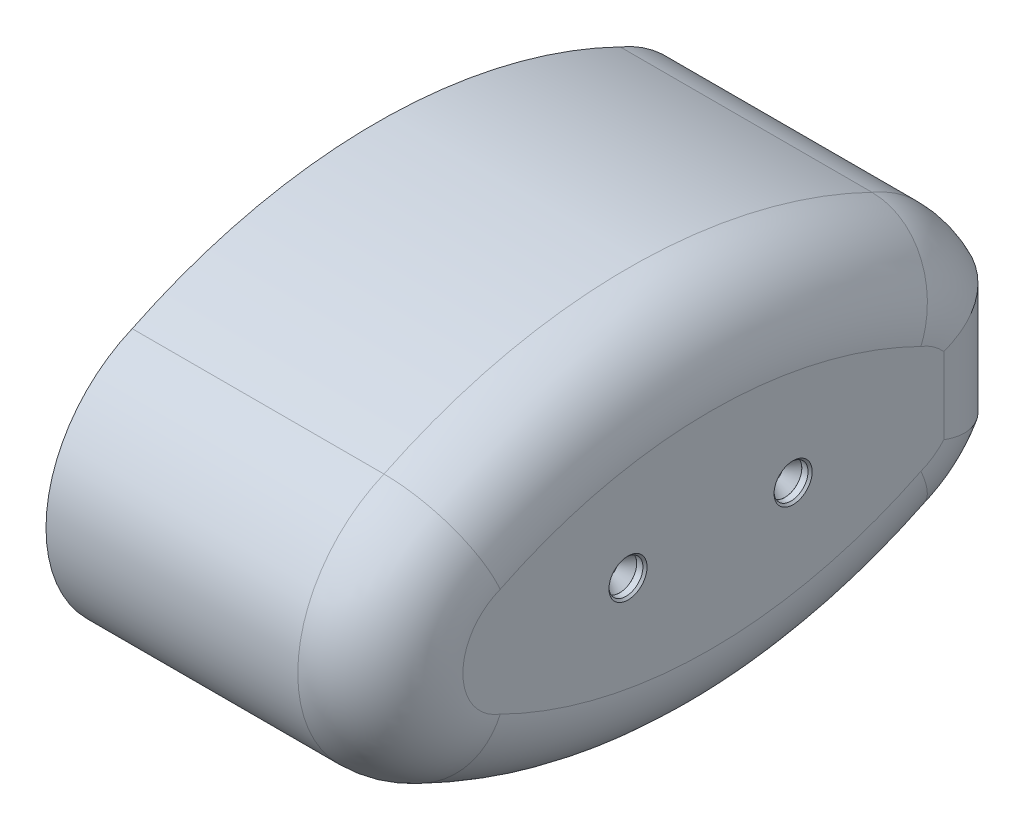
ISO-10303-21;
HEADER;
FILE_DESCRIPTION(('STEP AP214'),'2;1');
FILE_NAME('part.step','',(''),(''),'','','');
FILE_SCHEMA(('AUTOMOTIVE_DESIGN { 1 0 10303 214 1 1 1 1 }'));
ENDSEC;
DATA;
#1=APPLICATION_CONTEXT('core data for automotive mechanical design processes');
#2=APPLICATION_PROTOCOL_DEFINITION('international standard','automotive_design',2000,#1);
#3=PRODUCT_CONTEXT('',#1,'mechanical');
#4=PRODUCT('Part','Part','',(#3));
#5=PRODUCT_RELATED_PRODUCT_CATEGORY('part','',(#4));
#6=PRODUCT_DEFINITION_FORMATION('','',#4);
#7=PRODUCT_DEFINITION_CONTEXT('part definition',#1,'design');
#8=PRODUCT_DEFINITION('design','',#6,#7);
#9=PRODUCT_DEFINITION_SHAPE('','',#8);
#10=(LENGTH_UNIT() NAMED_UNIT(*) SI_UNIT(.MILLI.,.METRE.));
#11=(NAMED_UNIT(*) PLANE_ANGLE_UNIT() SI_UNIT($,.RADIAN.));
#12=(NAMED_UNIT(*) SI_UNIT($,.STERADIAN.) SOLID_ANGLE_UNIT());
#13=UNCERTAINTY_MEASURE_WITH_UNIT(LENGTH_MEASURE(1.E-05),#10,'distance_accuracy_value','');
#14=(GEOMETRIC_REPRESENTATION_CONTEXT(3) GLOBAL_UNCERTAINTY_ASSIGNED_CONTEXT((#13)) GLOBAL_UNIT_ASSIGNED_CONTEXT((#10,
#11,#12)) REPRESENTATION_CONTEXT('',''));
#15=CARTESIAN_POINT('',(0.,0.,0.));
#16=DIRECTION('',(0.,0.,1.));
#17=DIRECTION('',(1.,0.,0.));
#18=AXIS2_PLACEMENT_3D('',#15,#16,#17);
#19=CARTESIAN_POINT('',(0.,0.,23.));
#20=DIRECTION('',(-1.,0.,0.));
#21=DIRECTION('',(0.,0.,1.));
#22=AXIS2_PLACEMENT_3D('',#19,#20,#21);
#23=PLANE('',#22);
#24=CARTESIAN_POINT('',(0.,0.,23.));
#25=DIRECTION('',(1.,0.,0.));
#26=DIRECTION('',(0.,0.,1.));
#27=AXIS2_PLACEMENT_3D('',#24,#25,#26);
#28=CIRCLE('',#27,17.);
#29=CARTESIAN_POINT('',(0.,15.6837381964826,29.5589904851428));
#30=VERTEX_POINT('',#29);
#31=CARTESIAN_POINT('',(0.,-15.6837381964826,29.5589904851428));
#32=VERTEX_POINT('',#31);
#33=EDGE_CURVE('E475',#30,#32,#28,.T.);
#34=ORIENTED_EDGE('',*,*,#33,.F.);
#35=CARTESIAN_POINT('',(0.,-45.,0.));
#36=DIRECTION('',(1.,0.,0.));
#37=DIRECTION('',(0.,0.,-1.));
#38=AXIS2_PLACEMENT_3D('',#35,#36,#37);
#39=CIRCLE('',#38,67.5);
#40=CARTESIAN_POINT('',(0.,15.6837381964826,-29.5589904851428));
#41=VERTEX_POINT('',#40);
#42=EDGE_CURVE('E761',#41,#30,#39,.T.);
#43=ORIENTED_EDGE('',*,*,#42,.F.);
#44=CARTESIAN_POINT('',(0.,0.,-23.));
#45=DIRECTION('',(1.,0.,0.));
#46=DIRECTION('',(0.,0.,-1.));
#47=AXIS2_PLACEMENT_3D('',#44,#45,#46);
#48=CIRCLE('',#47,17.);
#49=CARTESIAN_POINT('',(0.,7.5,-38.2561463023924));
#50=VERTEX_POINT('',#49);
#51=EDGE_CURVE('E759',#50,#41,#48,.T.);
#52=ORIENTED_EDGE('',*,*,#51,.F.);
#53=DIRECTION('',(0.,1.,0.));
#54=VECTOR('',#53,1.);
#55=CARTESIAN_POINT('',(0.,7.5,-38.2561463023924));
#56=LINE('',#55,#54);
#57=CARTESIAN_POINT('',(0.,-7.5,-38.2561463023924));
#58=VERTEX_POINT('',#57);
#59=EDGE_CURVE('E766',#58,#50,#56,.T.);
#60=ORIENTED_EDGE('',*,*,#59,.F.);
#61=CARTESIAN_POINT('',(0.,0.,-23.));
#62=DIRECTION('',(1.,0.,0.));
#63=DIRECTION('',(0.,0.,-1.));
#64=AXIS2_PLACEMENT_3D('',#61,#62,#63);
#65=CIRCLE('',#64,17.);
#66=CARTESIAN_POINT('',(0.,-15.6837381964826,-29.5589904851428));
#67=VERTEX_POINT('',#66);
#68=EDGE_CURVE('E769',#67,#58,#65,.T.);
#69=ORIENTED_EDGE('',*,*,#68,.F.);
#70=CARTESIAN_POINT('',(0.,45.,0.));
#71=DIRECTION('',(1.,0.,0.));
#72=DIRECTION('',(0.,0.,-1.));
#73=AXIS2_PLACEMENT_3D('',#70,#71,#72);
#74=CIRCLE('',#73,67.5);
#75=EDGE_CURVE('E356',#32,#67,#74,.T.);
#76=ORIENTED_EDGE('',*,*,#75,.F.);
#77=EDGE_LOOP('',(#34,#43,#52,#60,#69,#76));
#78=FACE_BOUND('',#77,.T.);
#79=CARTESIAN_POINT('',(0.,-45.,0.));
#80=DIRECTION('',(-1.,0.,0.));
#81=DIRECTION('',(0.,0.,1.));
#82=AXIS2_PLACEMENT_3D('',#79,#80,#81);
#83=CIRCLE('',#82,65.5);
#84=CARTESIAN_POINT('',(0.,13.8600379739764,-28.7357952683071));
#85=VERTEX_POINT('',#84);
#86=CARTESIAN_POINT('',(0.,13.8600379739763,28.7357952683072));
#87=VERTEX_POINT('',#86);
#88=EDGE_CURVE('E176',#85,#87,#83,.F.);
#89=ORIENTED_EDGE('',*,*,#88,.T.);
#90=CARTESIAN_POINT('',(0.,0.,23.));
#91=DIRECTION('',(-1.,0.,0.));
#92=DIRECTION('',(0.,0.,1.));
#93=AXIS2_PLACEMENT_3D('',#90,#91,#92);
#94=CIRCLE('',#93,15.);
#95=CARTESIAN_POINT('',(0.,-13.8600379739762,28.7357952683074));
#96=VERTEX_POINT('',#95);
#97=EDGE_CURVE('E171',#87,#96,#94,.F.);
#98=ORIENTED_EDGE('',*,*,#97,.T.);
#99=CARTESIAN_POINT('',(0.,45.,0.));
#100=DIRECTION('',(-1.,0.,0.));
#101=DIRECTION('',(0.,0.,1.));
#102=AXIS2_PLACEMENT_3D('',#99,#100,#101);
#103=CIRCLE('',#102,65.5);
#104=CARTESIAN_POINT('',(0.,-13.8600379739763,-28.7357952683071));
#105=VERTEX_POINT('',#104);
#106=EDGE_CURVE('E190',#96,#105,#103,.F.);
#107=ORIENTED_EDGE('',*,*,#106,.T.);
#108=CARTESIAN_POINT('',(0.,0.,-23.));
#109=DIRECTION('',(-1.,0.,0.));
#110=DIRECTION('',(0.,0.,1.));
#111=AXIS2_PLACEMENT_3D('',#108,#109,#110);
#112=CIRCLE('',#111,15.);
#113=CARTESIAN_POINT('',(0.,-7.01958582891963,-36.2561463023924));
#114=VERTEX_POINT('',#113);
#115=EDGE_CURVE('E41',#105,#114,#112,.F.);
#116=ORIENTED_EDGE('',*,*,#115,.T.);
#117=DIRECTION('',(0.,1.,0.));
#118=VECTOR('',#117,1.);
#119=CARTESIAN_POINT('',(0.,0.,-36.2561463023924));
#120=LINE('',#119,#118);
#121=CARTESIAN_POINT('',(0.,7.01958582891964,-36.2561463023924));
#122=VERTEX_POINT('',#121);
#123=EDGE_CURVE('E517',#114,#122,#120,.T.);
#124=ORIENTED_EDGE('',*,*,#123,.T.);
#125=CARTESIAN_POINT('',(0.,0.,-23.));
#126=DIRECTION('',(-1.,0.,0.));
#127=DIRECTION('',(0.,0.,1.));
#128=AXIS2_PLACEMENT_3D('',#125,#126,#127);
#129=CIRCLE('',#128,15.);
#130=EDGE_CURVE('E520',#122,#85,#129,.F.);
#131=ORIENTED_EDGE('',*,*,#130,.T.);
#132=EDGE_LOOP('',(#89,#98,#107,#116,#124,#131));
#133=FACE_BOUND('',#132,.T.);
#134=ADVANCED_FACE('F26',(#78,#133),#23,.T.);
#135=CARTESIAN_POINT('',(40.5,0.,23.));
#136=DIRECTION('',(-1.,0.,0.));
#137=DIRECTION('',(0.,0.,1.));
#138=AXIS2_PLACEMENT_3D('',#135,#136,#137);
#139=CYLINDRICAL_SURFACE('',#138,17.);
#140=DIRECTION('',(-1.,0.,0.));
#141=VECTOR('',#140,1.);
#142=CARTESIAN_POINT('',(40.5,-15.6837381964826,29.5589904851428));
#143=LINE('',#142,#141);
#144=CARTESIAN_POINT('',(30.5,-15.6837381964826,29.5589904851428));
#145=VERTEX_POINT('',#144);
#146=EDGE_CURVE('E360',#145,#32,#143,.T.);
#147=ORIENTED_EDGE('',*,*,#146,.F.);
#148=CARTESIAN_POINT('',(30.5,0.,23.));
#149=DIRECTION('',(-1.,0.,0.));
#150=DIRECTION('',(0.,0.,1.));
#151=AXIS2_PLACEMENT_3D('',#148,#149,#150);
#152=CIRCLE('',#151,17.);
#153=CARTESIAN_POINT('',(30.5,15.6837381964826,29.5589904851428));
#154=VERTEX_POINT('',#153);
#155=EDGE_CURVE('E389',#145,#154,#152,.T.);
#156=ORIENTED_EDGE('',*,*,#155,.T.);
#157=DIRECTION('',(-1.,0.,0.));
#158=VECTOR('',#157,1.);
#159=CARTESIAN_POINT('',(40.5,15.6837381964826,29.5589904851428));
#160=LINE('',#159,#158);
#161=EDGE_CURVE('E755',#154,#30,#160,.T.);
#162=ORIENTED_EDGE('',*,*,#161,.T.);
#163=ORIENTED_EDGE('',*,*,#33,.T.);
#164=EDGE_LOOP('',(#147,#156,#162,#163));
#165=FACE_BOUND('',#164,.T.);
#166=ADVANCED_FACE('F28',(#165),#139,.T.);
#167=CARTESIAN_POINT('',(40.5,45.,0.));
#168=DIRECTION('',(-1.,0.,0.));
#169=DIRECTION('',(0.,0.,1.));
#170=AXIS2_PLACEMENT_3D('',#167,#168,#169);
#171=CYLINDRICAL_SURFACE('',#170,67.5);
#172=DIRECTION('',(-1.,0.,0.));
#173=VECTOR('',#172,1.);
#174=CARTESIAN_POINT('',(40.5,-15.6837381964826,-29.5589904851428));
#175=LINE('',#174,#173);
#176=CARTESIAN_POINT('',(30.5,-15.6837381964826,-29.5589904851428));
#177=VERTEX_POINT('',#176);
#178=EDGE_CURVE('E354',#177,#67,#175,.T.);
#179=ORIENTED_EDGE('',*,*,#178,.F.);
#180=CARTESIAN_POINT('',(30.5,45.,0.));
#181=DIRECTION('',(-1.,0.,0.));
#182=DIRECTION('',(0.,0.,1.));
#183=AXIS2_PLACEMENT_3D('',#180,#181,#182);
#184=CIRCLE('',#183,67.5);
#185=EDGE_CURVE('E49',#177,#145,#184,.T.);
#186=ORIENTED_EDGE('',*,*,#185,.T.);
#187=ORIENTED_EDGE('',*,*,#146,.T.);
#188=ORIENTED_EDGE('',*,*,#75,.T.);
#189=EDGE_LOOP('',(#179,#186,#187,#188));
#190=FACE_BOUND('',#189,.T.);
#191=ADVANCED_FACE('F322',(#190),#171,.T.);
#192=CARTESIAN_POINT('',(40.5,0.,-23.));
#193=DIRECTION('',(-1.,0.,0.));
#194=DIRECTION('',(0.,0.,1.));
#195=AXIS2_PLACEMENT_3D('',#192,#193,#194);
#196=CYLINDRICAL_SURFACE('',#195,17.);
#197=DIRECTION('',(-1.,0.,0.));
#198=VECTOR('',#197,1.);
#199=CARTESIAN_POINT('',(40.5,-7.5,-38.2561463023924));
#200=LINE('',#199,#198);
#201=CARTESIAN_POINT('',(30.5,-7.5,-38.2561463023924));
#202=VERTEX_POINT('',#201);
#203=EDGE_CURVE('E361',#202,#58,#200,.T.);
#204=ORIENTED_EDGE('',*,*,#203,.F.);
#205=CARTESIAN_POINT('',(30.5,0.,-23.));
#206=DIRECTION('',(-1.,0.,0.));
#207=DIRECTION('',(0.,0.,1.));
#208=AXIS2_PLACEMENT_3D('',#205,#206,#207);
#209=CIRCLE('',#208,17.);
#210=EDGE_CURVE('E381',#202,#177,#209,.T.);
#211=ORIENTED_EDGE('',*,*,#210,.T.);
#212=ORIENTED_EDGE('',*,*,#178,.T.);
#213=ORIENTED_EDGE('',*,*,#68,.T.);
#214=EDGE_LOOP('',(#204,#211,#212,#213));
#215=FACE_BOUND('',#214,.T.);
#216=ADVANCED_FACE('F346',(#215),#196,.T.);
#217=CARTESIAN_POINT('',(40.5,7.5,-38.2561463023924));
#218=DIRECTION('',(0.,0.,1.));
#219=DIRECTION('',(1.,0.,0.));
#220=AXIS2_PLACEMENT_3D('',#217,#218,#219);
#221=PLANE('',#220);
#222=DIRECTION('',(-1.,0.,0.));
#223=VECTOR('',#222,1.);
#224=CARTESIAN_POINT('',(40.5,7.5,-38.2561463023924));
#225=LINE('',#224,#223);
#226=CARTESIAN_POINT('',(30.5,7.5,-38.2561463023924));
#227=VERTEX_POINT('',#226);
#228=EDGE_CURVE('E365',#227,#50,#225,.T.);
#229=ORIENTED_EDGE('',*,*,#228,.F.);
#230=DIRECTION('',(0.,1.,0.));
#231=VECTOR('',#230,1.);
#232=CARTESIAN_POINT('',(30.5,7.5,-38.2561463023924));
#233=LINE('',#232,#231);
#234=EDGE_CURVE('E383',#227,#202,#233,.F.);
#235=ORIENTED_EDGE('',*,*,#234,.T.);
#236=ORIENTED_EDGE('',*,*,#203,.T.);
#237=ORIENTED_EDGE('',*,*,#59,.T.);
#238=EDGE_LOOP('',(#229,#235,#236,#237));
#239=FACE_BOUND('',#238,.T.);
#240=ADVANCED_FACE('F342',(#239),#221,.F.);
#241=CARTESIAN_POINT('',(40.5,0.,-23.));
#242=DIRECTION('',(-1.,0.,0.));
#243=DIRECTION('',(0.,0.,1.));
#244=AXIS2_PLACEMENT_3D('',#241,#242,#243);
#245=CYLINDRICAL_SURFACE('',#244,17.);
#246=DIRECTION('',(-1.,0.,0.));
#247=VECTOR('',#246,1.);
#248=CARTESIAN_POINT('',(40.5,15.6837381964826,-29.5589904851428));
#249=LINE('',#248,#247);
#250=CARTESIAN_POINT('',(30.5,15.6837381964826,-29.5589904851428));
#251=VERTEX_POINT('',#250);
#252=EDGE_CURVE('E753',#251,#41,#249,.T.);
#253=ORIENTED_EDGE('',*,*,#252,.F.);
#254=CARTESIAN_POINT('',(30.5,0.,-23.));
#255=DIRECTION('',(-1.,0.,0.));
#256=DIRECTION('',(0.,0.,1.));
#257=AXIS2_PLACEMENT_3D('',#254,#255,#256);
#258=CIRCLE('',#257,17.);
#259=EDGE_CURVE('E385',#251,#227,#258,.T.);
#260=ORIENTED_EDGE('',*,*,#259,.T.);
#261=ORIENTED_EDGE('',*,*,#228,.T.);
#262=ORIENTED_EDGE('',*,*,#51,.T.);
#263=EDGE_LOOP('',(#253,#260,#261,#262));
#264=FACE_BOUND('',#263,.T.);
#265=ADVANCED_FACE('F338',(#264),#245,.T.);
#266=CARTESIAN_POINT('',(40.5,-45.,0.));
#267=DIRECTION('',(-1.,0.,0.));
#268=DIRECTION('',(0.,0.,1.));
#269=AXIS2_PLACEMENT_3D('',#266,#267,#268);
#270=CYLINDRICAL_SURFACE('',#269,67.5);
#271=ORIENTED_EDGE('',*,*,#161,.F.);
#272=CARTESIAN_POINT('',(30.5,-45.,0.));
#273=DIRECTION('',(-1.,0.,0.));
#274=DIRECTION('',(0.,0.,1.));
#275=AXIS2_PLACEMENT_3D('',#272,#273,#274);
#276=CIRCLE('',#275,67.5);
#277=EDGE_CURVE('E387',#154,#251,#276,.T.);
#278=ORIENTED_EDGE('',*,*,#277,.T.);
#279=ORIENTED_EDGE('',*,*,#252,.T.);
#280=ORIENTED_EDGE('',*,*,#42,.T.);
#281=EDGE_LOOP('',(#271,#278,#279,#280));
#282=FACE_BOUND('',#281,.T.);
#283=ADVANCED_FACE('F334',(#282),#270,.T.);
#284=CARTESIAN_POINT('',(40.5,0.,23.));
#285=DIRECTION('',(-1.,0.,0.));
#286=DIRECTION('',(0.,0.,1.));
#287=AXIS2_PLACEMENT_3D('',#284,#285,#286);
#288=PLANE('',#287);
#289=CARTESIAN_POINT('',(40.5,0.,10.));
#290=DIRECTION('',(-1.,0.,0.));
#291=DIRECTION('',(0.,0.,1.));
#292=AXIS2_PLACEMENT_3D('',#289,#290,#291);
#293=CIRCLE('',#292,2.30740000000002);
#294=CARTESIAN_POINT('',(40.5,0.,12.3074));
#295=VERTEX_POINT('',#294);
#296=EDGE_CURVE('E34',#295,#295,#293,.T.);
#297=ORIENTED_EDGE('',*,*,#296,.T.);
#298=EDGE_LOOP('',(#297));
#299=FACE_BOUND('',#298,.T.);
#300=CARTESIAN_POINT('',(40.5,0.,-10.));
#301=DIRECTION('',(-1.,0.,0.));
#302=DIRECTION('',(0.,0.,1.));
#303=AXIS2_PLACEMENT_3D('',#300,#301,#302);
#304=CIRCLE('',#303,2.30740000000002);
#305=CARTESIAN_POINT('',(40.5,0.,-7.69259999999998));
#306=VERTEX_POINT('',#305);
#307=EDGE_CURVE('E427',#306,#306,#304,.T.);
#308=ORIENTED_EDGE('',*,*,#307,.T.);
#309=EDGE_LOOP('',(#308));
#310=FACE_BOUND('',#309,.T.);
#311=CARTESIAN_POINT('',(40.5,45.,0.));
#312=DIRECTION('',(-1.,0.,0.));
#313=DIRECTION('',(0.,0.,1.));
#314=AXIS2_PLACEMENT_3D('',#311,#312,#313);
#315=CIRCLE('',#314,57.5);
#316=CARTESIAN_POINT('',(40.5,-6.54489009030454,25.4828237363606));
#317=VERTEX_POINT('',#316);
#318=CARTESIAN_POINT('',(40.5,-6.54489009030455,-25.4828237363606));
#319=VERTEX_POINT('',#318);
#320=EDGE_CURVE('E363',#317,#319,#315,.F.);
#321=ORIENTED_EDGE('',*,*,#320,.T.);
#322=CARTESIAN_POINT('',(40.5,0.,-23.));
#323=DIRECTION('',(-1.,0.,0.));
#324=DIRECTION('',(0.,0.,1.));
#325=AXIS2_PLACEMENT_3D('',#322,#323,#324);
#326=CIRCLE('',#325,7.);
#327=CARTESIAN_POINT('',(40.5,-4.62308620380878,-28.2561463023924));
#328=VERTEX_POINT('',#327);
#329=EDGE_CURVE('E378',#319,#328,#326,.F.);
#330=ORIENTED_EDGE('',*,*,#329,.T.);
#331=DIRECTION('',(0.,1.,0.));
#332=VECTOR('',#331,1.);
#333=CARTESIAN_POINT('',(40.5,0.,-28.2561463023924));
#334=LINE('',#333,#332);
#335=CARTESIAN_POINT('',(40.5,4.62308620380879,-28.2561463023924));
#336=VERTEX_POINT('',#335);
#337=EDGE_CURVE('E376',#328,#336,#334,.T.);
#338=ORIENTED_EDGE('',*,*,#337,.T.);
#339=CARTESIAN_POINT('',(40.5,0.,-23.));
#340=DIRECTION('',(-1.,0.,0.));
#341=DIRECTION('',(0.,0.,1.));
#342=AXIS2_PLACEMENT_3D('',#339,#340,#341);
#343=CIRCLE('',#342,7.00000000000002);
#344=CARTESIAN_POINT('',(40.5,6.54489009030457,-25.4828237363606));
#345=VERTEX_POINT('',#344);
#346=EDGE_CURVE('E374',#336,#345,#343,.F.);
#347=ORIENTED_EDGE('',*,*,#346,.T.);
#348=CARTESIAN_POINT('',(40.5,-45.,0.));
#349=DIRECTION('',(-1.,0.,0.));
#350=DIRECTION('',(0.,0.,1.));
#351=AXIS2_PLACEMENT_3D('',#348,#349,#350);
#352=CIRCLE('',#351,57.5);
#353=CARTESIAN_POINT('',(40.5,6.54489009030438,25.4828237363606));
#354=VERTEX_POINT('',#353);
#355=EDGE_CURVE('E372',#345,#354,#352,.F.);
#356=ORIENTED_EDGE('',*,*,#355,.T.);
#357=CARTESIAN_POINT('',(40.5,0.,23.));
#358=DIRECTION('',(-1.,0.,0.));
#359=DIRECTION('',(0.,0.,1.));
#360=AXIS2_PLACEMENT_3D('',#357,#358,#359);
#361=CIRCLE('',#360,7.);
#362=EDGE_CURVE('E370',#354,#317,#361,.F.);
#363=ORIENTED_EDGE('',*,*,#362,.T.);
#364=EDGE_LOOP('',(#321,#330,#338,#347,#356,#363));
#365=FACE_BOUND('',#364,.T.);
#366=ADVANCED_FACE('F331',(#299,#310,#365),#288,.F.);
#367=CARTESIAN_POINT('',(30.5,-45.,0.));
#368=DIRECTION('',(-1.,0.,0.));
#369=DIRECTION('',(0.,0.,1.));
#370=AXIS2_PLACEMENT_3D('',#367,#368,#369);
#371=TOROIDAL_SURFACE('',#370,57.5,10.);
#372=CARTESIAN_POINT('',(30.5,15.6837381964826,-29.5589904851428));
#373=CARTESIAN_POINT('',(30.7811578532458,15.6837655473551,-29.5590034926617));
#374=CARTESIAN_POINT('',(31.0623113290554,15.6729307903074,-29.5541033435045));
#375=CARTESIAN_POINT('',(31.6226064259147,15.6297346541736,-29.5345706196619));
#376=CARTESIAN_POINT('',(31.9017481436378,15.5973743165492,-29.5199385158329));
#377=CARTESIAN_POINT('',(32.4558504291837,15.5113546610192,-29.4810493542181));
#378=CARTESIAN_POINT('',(32.7308137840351,15.4577102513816,-29.4567990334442));
#379=CARTESIAN_POINT('',(33.2748029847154,15.3295099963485,-29.3988576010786));
#380=CARTESIAN_POINT('',(33.5438289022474,15.2549544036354,-29.3651666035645));
#381=CARTESIAN_POINT('',(34.074159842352,15.0854152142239,-29.2885747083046));
#382=CARTESIAN_POINT('',(34.335461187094,14.9904220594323,-29.2456695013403));
#383=CARTESIAN_POINT('',(34.8483593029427,14.7806971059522,-29.1509768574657));
#384=CARTESIAN_POINT('',(35.0999558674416,14.6659648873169,-29.0991892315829));
#385=CARTESIAN_POINT('',(35.5915921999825,14.4176018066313,-28.9871311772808));
#386=CARTESIAN_POINT('',(35.8316346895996,14.2839754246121,-28.9268627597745));
#387=CARTESIAN_POINT('',(36.2985206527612,13.9987460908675,-28.7982834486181));
#388=CARTESIAN_POINT('',(36.5253641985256,13.8471432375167,-28.7299725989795));
#389=CARTESIAN_POINT('',(36.9642641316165,13.5270129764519,-28.5858114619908));
#390=CARTESIAN_POINT('',(37.1763191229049,13.3584839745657,-28.5099604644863));
#391=CARTESIAN_POINT('',(37.5841136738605,13.0056995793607,-28.35129222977));
#392=CARTESIAN_POINT('',(37.7798532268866,12.8214441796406,-28.2684749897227));
#393=CARTESIAN_POINT('',(38.1536879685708,12.4384420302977,-28.0964686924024));
#394=CARTESIAN_POINT('',(38.3317775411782,12.2396907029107,-28.007277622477));
#395=CARTESIAN_POINT('',(38.6689758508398,11.8291493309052,-27.8232209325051));
#396=CARTESIAN_POINT('',(38.8280849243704,11.6173595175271,-27.728355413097));
#397=CARTESIAN_POINT('',(39.1262910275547,11.1820900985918,-27.5336060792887));
#398=CARTESIAN_POINT('',(39.2653756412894,10.9586033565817,-27.4337192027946));
#399=CARTESIAN_POINT('',(39.5224282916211,10.5016340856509,-27.2297443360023));
#400=CARTESIAN_POINT('',(39.6403966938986,10.2681517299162,-27.125656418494));
#401=CARTESIAN_POINT('',(39.8543209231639,9.79296500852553,-26.9141386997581));
#402=CARTESIAN_POINT('',(39.950290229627,9.55126578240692,-26.8067109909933));
#403=CARTESIAN_POINT('',(40.1196061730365,9.06128457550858,-26.5893207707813));
#404=CARTESIAN_POINT('',(40.1929593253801,8.8130045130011,-26.4793589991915));
#405=CARTESIAN_POINT('',(40.3338830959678,8.24124496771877,-26.2266674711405));
#406=CARTESIAN_POINT('',(40.3940840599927,7.91617433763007,-26.0833834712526));
#407=CARTESIAN_POINT('',(40.4758522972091,7.26207831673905,-25.7960564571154));
#408=CARTESIAN_POINT('',(40.4974837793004,6.93306041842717,-25.6520151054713));
#409=CARTESIAN_POINT('',(40.4999311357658,6.58425627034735,-25.499976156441));
#410=CARTESIAN_POINT('',(40.5000001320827,6.56457313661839,-25.4913987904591));
#411=CARTESIAN_POINT('',(40.5,6.54489009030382,-25.4828237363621));
#412=B_SPLINE_CURVE_WITH_KNOTS('',3,(#372,#373,#374,#375,#376,#377,#378,#379,#380,#381,#382,
#383,#384,#385,#386,#387,#388,#389,#390,#391,#392,#393,#394,#395,#396,#397,#398,#399,#400,#401,
#402,#403,#404,#405,#406,#407,#408,#409,#410,#411),.UNSPECIFIED.,.F.,.F.,(4,2,2,2,2,2,2,2,2,2,2,
2,2,2,2,2,2,2,2,4),(0.,0.843216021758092,1.68639124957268,2.52897692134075,3.37155241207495,
4.21452281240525,5.05751114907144,5.90029993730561,6.74308411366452,7.5859477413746,
8.42881171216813,9.27194301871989,10.1150593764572,10.9586962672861,11.802318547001,
12.6454225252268,13.4882833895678,14.5671391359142,15.644197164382,15.7086095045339),.UNSPECIFIED.);
#413=EDGE_CURVE('E468',#251,#345,#412,.T.);
#414=ORIENTED_EDGE('',*,*,#413,.F.);
#415=ORIENTED_EDGE('',*,*,#277,.F.);
#416=CARTESIAN_POINT('',(30.5,15.6837381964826,29.5589904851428));
#417=CARTESIAN_POINT('',(30.7811578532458,15.683765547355,29.5590034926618));
#418=CARTESIAN_POINT('',(31.0623113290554,15.6729307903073,29.5541033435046));
#419=CARTESIAN_POINT('',(31.6226064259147,15.6297346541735,29.5345706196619));
#420=CARTESIAN_POINT('',(31.9017481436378,15.5973743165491,29.5199385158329));
#421=CARTESIAN_POINT('',(32.4558504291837,15.5113546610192,29.4810493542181));
#422=CARTESIAN_POINT('',(32.7308137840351,15.4577102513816,29.4567990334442));
#423=CARTESIAN_POINT('',(33.2748029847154,15.3295099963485,29.3988576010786));
#424=CARTESIAN_POINT('',(33.5438289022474,15.2549544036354,29.3651666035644));
#425=CARTESIAN_POINT('',(34.074159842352,15.085415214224,29.2885747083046));
#426=CARTESIAN_POINT('',(34.335461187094,14.9904220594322,29.2456695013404));
#427=CARTESIAN_POINT('',(34.8483593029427,14.7806971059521,29.1509768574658));
#428=CARTESIAN_POINT('',(35.0999558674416,14.6659648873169,29.0991892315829));
#429=CARTESIAN_POINT('',(35.5915921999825,14.4176018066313,28.9871311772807));
#430=CARTESIAN_POINT('',(35.8316346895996,14.2839754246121,28.9268627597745));
#431=CARTESIAN_POINT('',(36.2985206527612,13.9987460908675,28.7982834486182));
#432=CARTESIAN_POINT('',(36.5253641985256,13.8471432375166,28.7299725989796));
#433=CARTESIAN_POINT('',(36.9642641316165,13.5270129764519,28.5858114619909));
#434=CARTESIAN_POINT('',(37.1763191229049,13.3584839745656,28.5099604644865));
#435=CARTESIAN_POINT('',(37.5841136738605,13.0056995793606,28.3512922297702));
#436=CARTESIAN_POINT('',(37.7798532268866,12.8214441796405,28.2684749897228));
#437=CARTESIAN_POINT('',(38.1536879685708,12.4384420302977,28.0964686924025));
#438=CARTESIAN_POINT('',(38.3317775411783,12.2396907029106,28.0072776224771));
#439=CARTESIAN_POINT('',(38.6689758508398,11.8291493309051,27.8232209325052));
#440=CARTESIAN_POINT('',(38.8280849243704,11.617359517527,27.7283554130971));
#441=CARTESIAN_POINT('',(39.1262910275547,11.1820900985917,27.5336060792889));
#442=CARTESIAN_POINT('',(39.2653756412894,10.9586033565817,27.4337192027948));
#443=CARTESIAN_POINT('',(39.5224282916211,10.5016340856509,27.2297443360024));
#444=CARTESIAN_POINT('',(39.6403966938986,10.2681517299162,27.125656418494));
#445=CARTESIAN_POINT('',(39.8543209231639,9.7929650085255,26.9141386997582));
#446=CARTESIAN_POINT('',(39.950290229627,9.55126578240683,26.8067109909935));
#447=CARTESIAN_POINT('',(40.1196061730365,9.06128457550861,26.5893207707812));
#448=CARTESIAN_POINT('',(40.1929593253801,8.81300451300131,26.4793589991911));
#449=CARTESIAN_POINT('',(40.3338830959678,8.24124496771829,26.2266674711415));
#450=CARTESIAN_POINT('',(40.3940840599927,7.91617433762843,26.0833834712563));
#451=CARTESIAN_POINT('',(40.4758522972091,7.26207831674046,25.7960564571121));
#452=CARTESIAN_POINT('',(40.4974837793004,6.93306041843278,25.6520151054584));
#453=CARTESIAN_POINT('',(40.4999311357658,6.58425627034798,25.4999761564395));
#454=CARTESIAN_POINT('',(40.5000001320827,6.56457313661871,25.4913987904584));
#455=CARTESIAN_POINT('',(40.5,6.54489009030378,25.4828237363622));
#456=B_SPLINE_CURVE_WITH_KNOTS('',3,(#416,#417,#418,#419,#420,#421,#422,#423,#424,#425,#426,
#427,#428,#429,#430,#431,#432,#433,#434,#435,#436,#437,#438,#439,#440,#441,#442,#443,#444,#445,
#446,#447,#448,#449,#450,#451,#452,#453,#454,#455),.UNSPECIFIED.,.F.,.F.,(4,2,2,2,2,2,2,2,2,2,2,
2,2,2,2,2,2,2,2,4),(0.,0.843216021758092,1.68639124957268,2.52897692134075,3.37155241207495,
4.21452281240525,5.05751114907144,5.9002999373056,6.74308411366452,7.5859477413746,
8.42881171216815,9.27194301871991,10.1150593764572,10.9586962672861,11.802318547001,
12.6454225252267,13.4882833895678,14.5671391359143,15.644197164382,15.7086095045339),.UNSPECIFIED.);
#457=EDGE_CURVE('E471',#354,#154,#456,.F.);
#458=ORIENTED_EDGE('',*,*,#457,.F.);
#459=ORIENTED_EDGE('',*,*,#355,.F.);
#460=EDGE_LOOP('',(#414,#415,#458,#459));
#461=FACE_BOUND('',#460,.T.);
#462=ADVANCED_FACE('F328',(#461),#371,.T.);
#463=CARTESIAN_POINT('',(30.5,0.,23.));
#464=DIRECTION('',(-1.,0.,0.));
#465=DIRECTION('',(0.,0.,1.));
#466=AXIS2_PLACEMENT_3D('',#463,#464,#465);
#467=DEGENERATE_TOROIDAL_SURFACE('',#466,7.,10.,.T.);
#468=ORIENTED_EDGE('',*,*,#457,.T.);
#469=ORIENTED_EDGE('',*,*,#155,.F.);
#470=CARTESIAN_POINT('',(30.5,-15.6837381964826,29.5589904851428));
#471=CARTESIAN_POINT('',(30.7811578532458,-15.683765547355,29.559003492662));
#472=CARTESIAN_POINT('',(31.0623113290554,-15.6729307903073,29.5541033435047));
#473=CARTESIAN_POINT('',(31.6226064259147,-15.6297346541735,29.5345706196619));
#474=CARTESIAN_POINT('',(31.9017481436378,-15.5973743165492,29.5199385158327));
#475=CARTESIAN_POINT('',(32.4558504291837,-15.5113546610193,29.4810493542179));
#476=CARTESIAN_POINT('',(32.7308137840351,-15.4577102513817,29.4567990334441));
#477=CARTESIAN_POINT('',(33.2748029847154,-15.3295099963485,29.3988576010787));
#478=CARTESIAN_POINT('',(33.5438289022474,-15.2549544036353,29.3651666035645));
#479=CARTESIAN_POINT('',(34.074159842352,-15.0854152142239,29.2885747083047));
#480=CARTESIAN_POINT('',(34.335461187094,-14.9904220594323,29.2456695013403));
#481=CARTESIAN_POINT('',(34.8483593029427,-14.7806971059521,29.1509768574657));
#482=CARTESIAN_POINT('',(35.0999558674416,-14.6659648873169,29.0991892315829));
#483=CARTESIAN_POINT('',(35.5915921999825,-14.4176018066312,28.9871311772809));
#484=CARTESIAN_POINT('',(35.8316346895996,-14.2839754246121,28.9268627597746));
#485=CARTESIAN_POINT('',(36.2985206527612,-13.9987460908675,28.7982834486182));
#486=CARTESIAN_POINT('',(36.5253641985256,-13.8471432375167,28.7299725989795));
#487=CARTESIAN_POINT('',(36.9642641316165,-13.5270129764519,28.5858114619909));
#488=CARTESIAN_POINT('',(37.1763191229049,-13.3584839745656,28.5099604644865));
#489=CARTESIAN_POINT('',(37.5841136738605,-13.0056995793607,28.3512922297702));
#490=CARTESIAN_POINT('',(37.7798532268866,-12.8214441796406,28.2684749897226));
#491=CARTESIAN_POINT('',(38.1536879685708,-12.4384420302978,28.0964686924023));
#492=CARTESIAN_POINT('',(38.3317775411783,-12.2396907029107,28.007277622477));
#493=CARTESIAN_POINT('',(38.6689758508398,-11.8291493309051,27.8232209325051));
#494=CARTESIAN_POINT('',(38.8280849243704,-11.6173595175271,27.728355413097));
#495=CARTESIAN_POINT('',(39.1262910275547,-11.1820900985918,27.5336060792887));
#496=CARTESIAN_POINT('',(39.2653756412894,-10.9586033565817,27.4337192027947));
#497=CARTESIAN_POINT('',(39.5224282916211,-10.5016340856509,27.2297443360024));
#498=CARTESIAN_POINT('',(39.6403966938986,-10.2681517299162,27.125656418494));
#499=CARTESIAN_POINT('',(39.8543209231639,-9.79296500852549,26.9141386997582));
#500=CARTESIAN_POINT('',(39.950290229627,-9.55126578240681,26.8067109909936));
#501=CARTESIAN_POINT('',(40.1196061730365,-9.06128457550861,26.5893207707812));
#502=CARTESIAN_POINT('',(40.1929593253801,-8.81300451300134,26.479358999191));
#503=CARTESIAN_POINT('',(40.3338830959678,-8.24124496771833,26.2266674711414));
#504=CARTESIAN_POINT('',(40.3940840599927,-7.91617433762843,26.0833834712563));
#505=CARTESIAN_POINT('',(40.4758522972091,-7.26207831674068,25.7960564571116));
#506=CARTESIAN_POINT('',(40.4974837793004,-6.93306041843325,25.6520151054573));
#507=CARTESIAN_POINT('',(40.4999311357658,-6.58425627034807,25.4999761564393));
#508=CARTESIAN_POINT('',(40.5000001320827,-6.56457313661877,25.4913987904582));
#509=CARTESIAN_POINT('',(40.5,-6.54489009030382,25.4828237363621));
#510=B_SPLINE_CURVE_WITH_KNOTS('',3,(#470,#471,#472,#473,#474,#475,#476,#477,#478,#479,#480,
#481,#482,#483,#484,#485,#486,#487,#488,#489,#490,#491,#492,#493,#494,#495,#496,#497,#498,#499,
#500,#501,#502,#503,#504,#505,#506,#507,#508,#509),.UNSPECIFIED.,.F.,.F.,(4,2,2,2,2,2,2,2,2,2,2,
2,2,2,2,2,2,2,2,4),(0.,0.843216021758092,1.68639124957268,2.52897692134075,3.37155241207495,
4.21452281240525,5.05751114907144,5.9002999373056,6.74308411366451,7.5859477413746,
8.42881171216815,9.27194301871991,10.1150593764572,10.9586962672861,11.802318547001,
12.6454225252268,13.4882833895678,14.5671391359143,15.644197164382,15.7086095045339),.UNSPECIFIED.);
#511=EDGE_CURVE('E472',#317,#145,#510,.F.);
#512=ORIENTED_EDGE('',*,*,#511,.F.);
#513=ORIENTED_EDGE('',*,*,#362,.F.);
#514=EDGE_LOOP('',(#468,#469,#512,#513));
#515=FACE_BOUND('',#514,.T.);
#516=ADVANCED_FACE('F493',(#515),#467,.T.);
#517=CARTESIAN_POINT('',(30.5,0.,-23.));
#518=DIRECTION('',(-1.,0.,0.));
#519=DIRECTION('',(0.,0.,1.));
#520=AXIS2_PLACEMENT_3D('',#517,#518,#519);
#521=DEGENERATE_TOROIDAL_SURFACE('',#520,7.00000000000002,10.,.T.);
#522=ORIENTED_EDGE('',*,*,#413,.T.);
#523=ORIENTED_EDGE('',*,*,#346,.F.);
#524=CARTESIAN_POINT('',(30.5,7.5,-38.2561463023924));
#525=CARTESIAN_POINT('',(30.775442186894,7.50000184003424,-38.256180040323));
#526=CARTESIAN_POINT('',(31.0508781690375,7.49735406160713,-38.2447674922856));
#527=CARTESIAN_POINT('',(31.5997492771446,7.48677296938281,-38.1992944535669));
#528=CARTESIAN_POINT('',(31.8731845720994,7.47884010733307,-38.1652358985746));
#529=CARTESIAN_POINT('',(32.4157710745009,7.45771588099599,-38.0747725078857));
#530=CARTESIAN_POINT('',(32.6849272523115,7.44453116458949,-38.0183959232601));
#531=CARTESIAN_POINT('',(33.2173959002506,7.41292893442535,-37.8837710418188));
#532=CARTESIAN_POINT('',(33.4807084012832,7.39451144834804,-37.8055228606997));
#533=CARTESIAN_POINT('',(33.9997099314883,7.35247183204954,-37.6277680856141));
#534=CARTESIAN_POINT('',(34.255396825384,7.32884825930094,-37.5282555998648));
#535=CARTESIAN_POINT('',(34.7572966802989,7.27644152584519,-37.3087946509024));
#536=CARTESIAN_POINT('',(35.0035095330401,7.24765830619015,-37.1888459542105));
#537=CARTESIAN_POINT('',(35.4847535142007,7.18498454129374,-36.9294928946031));
#538=CARTESIAN_POINT('',(35.7197856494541,7.15109445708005,-36.790090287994));
#539=CARTESIAN_POINT('',(36.1771181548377,7.07825983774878,-36.4929353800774));
#540=CARTESIAN_POINT('',(36.3994184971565,7.03931529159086,-36.3351830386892));
#541=CARTESIAN_POINT('',(36.8316907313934,6.9560727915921,-36.0011410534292));
#542=CARTESIAN_POINT('',(37.0415399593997,6.91173162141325,-35.82470346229));
#543=CARTESIAN_POINT('',(37.4454578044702,6.81802798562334,-35.4558284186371));
#544=CARTESIAN_POINT('',(37.6395263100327,6.76866548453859,-35.2633908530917));
#545=CARTESIAN_POINT('',(38.0107175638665,6.66496850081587,-34.8639799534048));
#546=CARTESIAN_POINT('',(38.1878366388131,6.61063294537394,-34.6570034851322));
#547=CARTESIAN_POINT('',(38.5240310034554,6.49705568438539,-34.2301513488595));
#548=CARTESIAN_POINT('',(38.6831062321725,6.43781396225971,-34.0102756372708));
#549=CARTESIAN_POINT('',(38.985752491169,6.31305950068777,-33.5541293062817));
#550=CARTESIAN_POINT('',(39.1288851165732,6.24743423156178,-33.3175985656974));
#551=CARTESIAN_POINT('',(39.3945724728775,6.11113692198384,-32.8346335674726));
#552=CARTESIAN_POINT('',(39.5171262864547,6.04046465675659,-32.5881988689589));
#553=CARTESIAN_POINT('',(39.7410540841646,5.89410044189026,-32.0873559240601));
#554=CARTESIAN_POINT('',(39.8424292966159,5.81840878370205,-31.8329481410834));
#555=CARTESIAN_POINT('',(40.0235942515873,5.66200148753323,-31.3181060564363));
#556=CARTESIAN_POINT('',(40.103387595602,5.5812866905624,-31.0576727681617));
#557=CARTESIAN_POINT('',(40.2267184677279,5.43227511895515,-30.5878677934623));
#558=CARTESIAN_POINT('',(40.2743507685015,5.36492959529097,-30.379256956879));
#559=CARTESIAN_POINT('',(40.3560062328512,5.22702450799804,-29.9604478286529));
#560=CARTESIAN_POINT('',(40.3900303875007,5.15646517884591,-29.7502496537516));
#561=CARTESIAN_POINT('',(40.4444769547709,5.0121845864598,-29.3295940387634));
#562=CARTESIAN_POINT('',(40.4649222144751,4.93846885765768,-29.1191376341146));
#563=CARTESIAN_POINT('',(40.4924268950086,4.78767140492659,-28.6986114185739));
#564=CARTESIAN_POINT('',(40.499491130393,4.71059090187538,-28.4885414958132));
#565=CARTESIAN_POINT('',(40.4999911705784,4.62887425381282,-28.2714980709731));
#566=CARTESIAN_POINT('',(40.500000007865,4.62598140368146,-28.2638216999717));
#567=CARTESIAN_POINT('',(40.5,4.62308620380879,-28.2561463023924));
#568=B_SPLINE_CURVE_WITH_KNOTS('',3,(#524,#525,#526,#527,#528,#529,#530,#531,#532,#533,#534,
#535,#536,#537,#538,#539,#540,#541,#542,#543,#544,#545,#546,#547,#548,#549,#550,#551,#552,#553,
#554,#555,#556,#557,#558,#559,#560,#561,#562,#563,#564,#565,#566,#567),.UNSPECIFIED.,.F.,.F.,(4,
2,2,2,2,2,2,2,2,2,2,2,2,2,2,2,2,2,2,2,2,4),(0.,0.826068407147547,1.65206621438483,
2.47702176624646,3.30197295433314,4.12715301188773,4.95234249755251,5.77745753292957,
6.60257437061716,7.43479732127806,8.26702615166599,9.09943493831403,9.93184653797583,
10.7833181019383,11.6348276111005,12.4862877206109,13.3376056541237,14.0101661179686,
14.6826775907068,15.3540546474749,16.0251900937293,16.0498001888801),.UNSPECIFIED.);
#569=EDGE_CURVE('E449',#227,#336,#568,.T.);
#570=ORIENTED_EDGE('',*,*,#569,.F.);
#571=ORIENTED_EDGE('',*,*,#259,.F.);
#572=EDGE_LOOP('',(#522,#523,#570,#571));
#573=FACE_BOUND('',#572,.T.);
#574=ADVANCED_FACE('F465',(#573),#521,.T.);
#575=CARTESIAN_POINT('',(30.5,45.,0.));
#576=DIRECTION('',(-1.,0.,0.));
#577=DIRECTION('',(0.,0.,1.));
#578=AXIS2_PLACEMENT_3D('',#575,#576,#577);
#579=TOROIDAL_SURFACE('',#578,57.5,10.);
#580=ORIENTED_EDGE('',*,*,#511,.T.);
#581=ORIENTED_EDGE('',*,*,#185,.F.);
#582=CARTESIAN_POINT('',(30.5,-15.6837381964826,-29.5589904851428));
#583=CARTESIAN_POINT('',(30.7811578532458,-15.683765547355,-29.5590034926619));
#584=CARTESIAN_POINT('',(31.0623113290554,-15.6729307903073,-29.5541033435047));
#585=CARTESIAN_POINT('',(31.6226064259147,-15.6297346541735,-29.534570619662));
#586=CARTESIAN_POINT('',(31.9017481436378,-15.5973743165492,-29.5199385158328));
#587=CARTESIAN_POINT('',(32.4558504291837,-15.5113546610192,-29.4810493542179));
#588=CARTESIAN_POINT('',(32.7308137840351,-15.4577102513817,-29.456799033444));
#589=CARTESIAN_POINT('',(33.2748029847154,-15.3295099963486,-29.3988576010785));
#590=CARTESIAN_POINT('',(33.5438289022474,-15.2549544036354,-29.3651666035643));
#591=CARTESIAN_POINT('',(34.074159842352,-15.085415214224,-29.2885747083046));
#592=CARTESIAN_POINT('',(34.335461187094,-14.9904220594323,-29.2456695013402));
#593=CARTESIAN_POINT('',(34.8483593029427,-14.7806971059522,-29.1509768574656));
#594=CARTESIAN_POINT('',(35.0999558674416,-14.665964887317,-29.0991892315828));
#595=CARTESIAN_POINT('',(35.5915921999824,-14.4176018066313,-28.9871311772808));
#596=CARTESIAN_POINT('',(35.8316346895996,-14.2839754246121,-28.9268627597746));
#597=CARTESIAN_POINT('',(36.2985206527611,-13.9987460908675,-28.7982834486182));
#598=CARTESIAN_POINT('',(36.5253641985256,-13.8471432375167,-28.7299725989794));
#599=CARTESIAN_POINT('',(36.9642641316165,-13.5270129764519,-28.5858114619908));
#600=CARTESIAN_POINT('',(37.1763191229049,-13.3584839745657,-28.5099604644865));
#601=CARTESIAN_POINT('',(37.5841136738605,-13.0056995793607,-28.3512922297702));
#602=CARTESIAN_POINT('',(37.7798532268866,-12.8214441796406,-28.2684749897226));
#603=CARTESIAN_POINT('',(38.1536879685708,-12.4384420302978,-28.0964686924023));
#604=CARTESIAN_POINT('',(38.3317775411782,-12.2396907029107,-28.007277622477));
#605=CARTESIAN_POINT('',(38.6689758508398,-11.8291493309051,-27.8232209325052));
#606=CARTESIAN_POINT('',(38.8280849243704,-11.617359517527,-27.7283554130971));
#607=CARTESIAN_POINT('',(39.1262910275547,-11.1820900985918,-27.5336060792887));
#608=CARTESIAN_POINT('',(39.2653756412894,-10.9586033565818,-27.4337192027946));
#609=CARTESIAN_POINT('',(39.5224282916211,-10.5016340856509,-27.2297443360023));
#610=CARTESIAN_POINT('',(39.6403966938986,-10.2681517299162,-27.1256564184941));
#611=CARTESIAN_POINT('',(39.8543209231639,-9.79296500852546,-26.9141386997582));
#612=CARTESIAN_POINT('',(39.950290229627,-9.55126578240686,-26.8067109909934));
#613=CARTESIAN_POINT('',(40.1196061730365,-9.06128457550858,-26.5893207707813));
#614=CARTESIAN_POINT('',(40.1929593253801,-8.81300451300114,-26.4793589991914));
#615=CARTESIAN_POINT('',(40.3338830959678,-8.24124496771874,-26.2266674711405));
#616=CARTESIAN_POINT('',(40.3940840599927,-7.91617433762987,-26.0833834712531));
#617=CARTESIAN_POINT('',(40.4758522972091,-7.2620783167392,-25.7960564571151));
#618=CARTESIAN_POINT('',(40.4974837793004,-6.93306041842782,-25.6520151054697));
#619=CARTESIAN_POINT('',(40.4999311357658,-6.58425627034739,-25.4999761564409));
#620=CARTESIAN_POINT('',(40.5000001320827,-6.56457313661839,-25.4913987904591));
#621=CARTESIAN_POINT('',(40.5,-6.54489009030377,-25.4828237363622));
#622=B_SPLINE_CURVE_WITH_KNOTS('',3,(#582,#583,#584,#585,#586,#587,#588,#589,#590,#591,#592,
#593,#594,#595,#596,#597,#598,#599,#600,#601,#602,#603,#604,#605,#606,#607,#608,#609,#610,#611,
#612,#613,#614,#615,#616,#617,#618,#619,#620,#621),.UNSPECIFIED.,.F.,.F.,(4,2,2,2,2,2,2,2,2,2,2,
2,2,2,2,2,2,2,2,4),(0.,0.843216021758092,1.68639124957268,2.52897692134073,3.37155241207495,
4.21452281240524,5.05751114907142,5.90029993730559,6.74308411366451,7.58594774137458,
8.42881171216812,9.27194301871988,10.1150593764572,10.9586962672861,11.802318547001,
12.6454225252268,13.4882833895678,14.5671391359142,15.644197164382,15.7086095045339),.UNSPECIFIED.);
#623=EDGE_CURVE('E445',#319,#177,#622,.F.);
#624=ORIENTED_EDGE('',*,*,#623,.F.);
#625=ORIENTED_EDGE('',*,*,#320,.F.);
#626=EDGE_LOOP('',(#580,#581,#624,#625));
#627=FACE_BOUND('',#626,.T.);
#628=ADVANCED_FACE('F446',(#627),#579,.T.);
#629=CARTESIAN_POINT('',(30.5,0.,-28.2561463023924));
#630=DIRECTION('',(0.,1.,0.));
#631=DIRECTION('',(0.,0.,1.));
#632=AXIS2_PLACEMENT_3D('',#629,#630,#631);
#633=CYLINDRICAL_SURFACE('',#632,10.);
#634=ORIENTED_EDGE('',*,*,#569,.T.);
#635=ORIENTED_EDGE('',*,*,#337,.F.);
#636=CARTESIAN_POINT('',(30.5,-7.5,-38.2561463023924));
#637=CARTESIAN_POINT('',(30.775442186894,-7.50000184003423,-38.256180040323));
#638=CARTESIAN_POINT('',(31.0508781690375,-7.49735406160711,-38.2447674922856));
#639=CARTESIAN_POINT('',(31.5997492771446,-7.48677296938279,-38.1992944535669));
#640=CARTESIAN_POINT('',(31.8731845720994,-7.47884010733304,-38.1652358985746));
#641=CARTESIAN_POINT('',(32.4157710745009,-7.45771588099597,-38.0747725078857));
#642=CARTESIAN_POINT('',(32.6849272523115,-7.44453116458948,-38.0183959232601));
#643=CARTESIAN_POINT('',(33.2173959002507,-7.41292893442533,-37.8837710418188));
#644=CARTESIAN_POINT('',(33.4807084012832,-7.39451144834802,-37.8055228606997));
#645=CARTESIAN_POINT('',(33.9997099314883,-7.35247183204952,-37.6277680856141));
#646=CARTESIAN_POINT('',(34.255396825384,-7.32884825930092,-37.5282555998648));
#647=CARTESIAN_POINT('',(34.7572966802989,-7.27644152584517,-37.3087946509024));
#648=CARTESIAN_POINT('',(35.0035095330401,-7.24765830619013,-37.1888459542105));
#649=CARTESIAN_POINT('',(35.4847535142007,-7.18498454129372,-36.9294928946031));
#650=CARTESIAN_POINT('',(35.7197856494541,-7.15109445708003,-36.790090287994));
#651=CARTESIAN_POINT('',(36.1771181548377,-7.07825983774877,-36.4929353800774));
#652=CARTESIAN_POINT('',(36.3994184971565,-7.03931529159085,-36.3351830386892));
#653=CARTESIAN_POINT('',(36.8316907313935,-6.95607279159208,-36.0011410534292));
#654=CARTESIAN_POINT('',(37.0415399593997,-6.91173162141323,-35.82470346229));
#655=CARTESIAN_POINT('',(37.4454578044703,-6.81802798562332,-35.455828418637));
#656=CARTESIAN_POINT('',(37.6395263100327,-6.76866548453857,-35.2633908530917));
#657=CARTESIAN_POINT('',(38.0107175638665,-6.66496850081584,-34.8639799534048));
#658=CARTESIAN_POINT('',(38.1878366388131,-6.61063294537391,-34.6570034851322));
#659=CARTESIAN_POINT('',(38.5240310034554,-6.49705568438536,-34.2301513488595));
#660=CARTESIAN_POINT('',(38.6831062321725,-6.43781396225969,-34.0102756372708));
#661=CARTESIAN_POINT('',(38.985752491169,-6.31305950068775,-33.5541293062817));
#662=CARTESIAN_POINT('',(39.1288851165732,-6.24743423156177,-33.3175985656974));
#663=CARTESIAN_POINT('',(39.3945724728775,-6.11113692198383,-32.8346335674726));
#664=CARTESIAN_POINT('',(39.5171262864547,-6.04046465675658,-32.5881988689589));
#665=CARTESIAN_POINT('',(39.7410540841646,-5.89410044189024,-32.0873559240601));
#666=CARTESIAN_POINT('',(39.8424292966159,-5.81840878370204,-31.8329481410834));
#667=CARTESIAN_POINT('',(40.0235942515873,-5.66200148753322,-31.3181060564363));
#668=CARTESIAN_POINT('',(40.103387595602,-5.58128669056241,-31.0576727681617));
#669=CARTESIAN_POINT('',(40.2267184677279,-5.43227511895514,-30.5878677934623));
#670=CARTESIAN_POINT('',(40.2743507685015,-5.36492959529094,-30.379256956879));
#671=CARTESIAN_POINT('',(40.3560062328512,-5.22702450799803,-29.9604478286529));
#672=CARTESIAN_POINT('',(40.3900303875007,-5.15646517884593,-29.7502496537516));
#673=CARTESIAN_POINT('',(40.4444769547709,-5.01218458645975,-29.3295940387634));
#674=CARTESIAN_POINT('',(40.4649222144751,-4.93846885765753,-29.1191376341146));
#675=CARTESIAN_POINT('',(40.4924268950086,-4.78767140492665,-28.6986114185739));
#676=CARTESIAN_POINT('',(40.499491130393,-4.71059090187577,-28.4885414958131));
#677=CARTESIAN_POINT('',(40.4999911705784,-4.62887425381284,-28.2714980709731));
#678=CARTESIAN_POINT('',(40.500000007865,-4.62598140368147,-28.2638216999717));
#679=CARTESIAN_POINT('',(40.5,-4.62308620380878,-28.2561463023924));
#680=B_SPLINE_CURVE_WITH_KNOTS('',3,(#636,#637,#638,#639,#640,#641,#642,#643,#644,#645,#646,
#647,#648,#649,#650,#651,#652,#653,#654,#655,#656,#657,#658,#659,#660,#661,#662,#663,#664,#665,
#666,#667,#668,#669,#670,#671,#672,#673,#674,#675,#676,#677,#678,#679),.UNSPECIFIED.,.F.,.F.,(4,
2,2,2,2,2,2,2,2,2,2,2,2,2,2,2,2,2,2,2,2,4),(0.,0.826068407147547,1.65206621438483,
2.47702176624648,3.30197295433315,4.12715301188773,4.95234249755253,5.77745753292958,
6.60257437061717,7.43479732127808,8.267026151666,9.09943493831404,9.93184653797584,
10.7833181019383,11.6348276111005,12.4862877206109,13.3376056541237,14.0101661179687,
14.6826775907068,15.3540546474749,16.0251900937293,16.0498001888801),.UNSPECIFIED.);
#681=EDGE_CURVE('E450',#202,#328,#680,.T.);
#682=ORIENTED_EDGE('',*,*,#681,.F.);
#683=ORIENTED_EDGE('',*,*,#234,.F.);
#684=EDGE_LOOP('',(#634,#635,#682,#683));
#685=FACE_BOUND('',#684,.T.);
#686=ADVANCED_FACE('F459',(#685),#633,.T.);
#687=CARTESIAN_POINT('',(30.5,0.,-23.));
#688=DIRECTION('',(-1.,0.,0.));
#689=DIRECTION('',(0.,0.,1.));
#690=AXIS2_PLACEMENT_3D('',#687,#688,#689);
#691=DEGENERATE_TOROIDAL_SURFACE('',#690,7.,10.,.T.);
#692=ORIENTED_EDGE('',*,*,#623,.T.);
#693=ORIENTED_EDGE('',*,*,#210,.F.);
#694=ORIENTED_EDGE('',*,*,#681,.T.);
#695=ORIENTED_EDGE('',*,*,#329,.F.);
#696=EDGE_LOOP('',(#692,#693,#694,#695));
#697=FACE_BOUND('',#696,.T.);
#698=ADVANCED_FACE('F452',(#697),#691,.T.);
#699=CARTESIAN_POINT('',(40.5,0.,23.));
#700=DIRECTION('',(-1.,0.,0.));
#701=DIRECTION('',(0.,0.,1.));
#702=AXIS2_PLACEMENT_3D('',#699,#700,#701);
#703=CYLINDRICAL_SURFACE('',#702,15.);
#704=DIRECTION('',(-1.,0.,0.));
#705=VECTOR('',#704,1.);
#706=CARTESIAN_POINT('',(40.5,-13.8600379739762,28.7357952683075));
#707=LINE('',#706,#705);
#708=CARTESIAN_POINT('',(30.4999999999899,-13.8600379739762,28.7357952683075));
#709=VERTEX_POINT('',#708);
#710=EDGE_CURVE('E552',#709,#96,#707,.T.);
#711=ORIENTED_EDGE('',*,*,#710,.T.);
#712=ORIENTED_EDGE('',*,*,#97,.F.);
#713=DIRECTION('',(-1.,0.,0.));
#714=VECTOR('',#713,1.);
#715=CARTESIAN_POINT('',(40.5,13.8600379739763,28.7357952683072));
#716=LINE('',#715,#714);
#717=CARTESIAN_POINT('',(30.4999999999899,13.8600379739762,28.7357952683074));
#718=VERTEX_POINT('',#717);
#719=EDGE_CURVE('E167',#718,#87,#716,.T.);
#720=ORIENTED_EDGE('',*,*,#719,.F.);
#721=CARTESIAN_POINT('',(30.5,0.,23.));
#722=DIRECTION('',(-1.,0.,0.));
#723=DIRECTION('',(0.,0.,1.));
#724=AXIS2_PLACEMENT_3D('',#721,#722,#723);
#725=CIRCLE('',#724,15.);
#726=EDGE_CURVE('E154',#709,#718,#725,.T.);
#727=ORIENTED_EDGE('',*,*,#726,.F.);
#728=EDGE_LOOP('',(#711,#712,#720,#727));
#729=FACE_BOUND('',#728,.T.);
#730=ADVANCED_FACE('F169',(#729),#703,.F.);
#731=CARTESIAN_POINT('',(40.5,45.,0.));
#732=DIRECTION('',(-1.,0.,0.));
#733=DIRECTION('',(0.,0.,1.));
#734=AXIS2_PLACEMENT_3D('',#731,#732,#733);
#735=CYLINDRICAL_SURFACE('',#734,65.5);
#736=DIRECTION('',(-1.,0.,0.));
#737=VECTOR('',#736,1.);
#738=CARTESIAN_POINT('',(40.5,-13.8600379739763,-28.7357952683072));
#739=LINE('',#738,#737);
#740=CARTESIAN_POINT('',(30.4999999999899,-13.8600379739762,-28.7357952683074));
#741=VERTEX_POINT('',#740);
#742=EDGE_CURVE('E550',#741,#105,#739,.T.);
#743=ORIENTED_EDGE('',*,*,#742,.T.);
#744=ORIENTED_EDGE('',*,*,#106,.F.);
#745=ORIENTED_EDGE('',*,*,#710,.F.);
#746=CARTESIAN_POINT('',(30.5,45.,0.));
#747=DIRECTION('',(-1.,0.,0.));
#748=DIRECTION('',(0.,0.,1.));
#749=AXIS2_PLACEMENT_3D('',#746,#747,#748);
#750=CIRCLE('',#749,65.5);
#751=EDGE_CURVE('E163',#741,#709,#750,.T.);
#752=ORIENTED_EDGE('',*,*,#751,.F.);
#753=EDGE_LOOP('',(#743,#744,#745,#752));
#754=FACE_BOUND('',#753,.T.);
#755=ADVANCED_FACE('F578',(#754),#735,.F.);
#756=CARTESIAN_POINT('',(40.5,0.,-23.));
#757=DIRECTION('',(-1.,0.,0.));
#758=DIRECTION('',(0.,0.,1.));
#759=AXIS2_PLACEMENT_3D('',#756,#757,#758);
#760=CYLINDRICAL_SURFACE('',#759,15.);
#761=DIRECTION('',(-1.,0.,0.));
#762=VECTOR('',#761,1.);
#763=CARTESIAN_POINT('',(40.5,-7.01958582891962,-36.2561463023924));
#764=LINE('',#763,#762);
#765=CARTESIAN_POINT('',(30.5000000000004,-7.01958582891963,-36.2561463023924));
#766=VERTEX_POINT('',#765);
#767=EDGE_CURVE('E531',#766,#114,#764,.T.);
#768=ORIENTED_EDGE('',*,*,#767,.T.);
#769=ORIENTED_EDGE('',*,*,#115,.F.);
#770=ORIENTED_EDGE('',*,*,#742,.F.);
#771=CARTESIAN_POINT('',(30.5,0.,-23.));
#772=DIRECTION('',(-1.,0.,0.));
#773=DIRECTION('',(0.,0.,1.));
#774=AXIS2_PLACEMENT_3D('',#771,#772,#773);
#775=CIRCLE('',#774,15.);
#776=EDGE_CURVE('E536',#766,#741,#775,.T.);
#777=ORIENTED_EDGE('',*,*,#776,.F.);
#778=EDGE_LOOP('',(#768,#769,#770,#777));
#779=FACE_BOUND('',#778,.T.);
#780=ADVANCED_FACE('F579',(#779),#760,.F.);
#781=CARTESIAN_POINT('',(40.5,7.5,-36.2561463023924));
#782=DIRECTION('',(0.,0.,1.));
#783=DIRECTION('',(1.,0.,0.));
#784=AXIS2_PLACEMENT_3D('',#781,#782,#783);
#785=PLANE('',#784);
#786=DIRECTION('',(-1.,0.,0.));
#787=VECTOR('',#786,1.);
#788=CARTESIAN_POINT('',(40.5,7.01958582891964,-36.2561463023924));
#789=LINE('',#788,#787);
#790=CARTESIAN_POINT('',(30.5,7.01958582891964,-36.2561463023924));
#791=VERTEX_POINT('',#790);
#792=EDGE_CURVE('E528',#791,#122,#789,.T.);
#793=ORIENTED_EDGE('',*,*,#792,.T.);
#794=ORIENTED_EDGE('',*,*,#123,.F.);
#795=ORIENTED_EDGE('',*,*,#767,.F.);
#796=DIRECTION('',(0.,1.,0.));
#797=VECTOR('',#796,1.);
#798=CARTESIAN_POINT('',(30.5,7.5,-36.2561463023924));
#799=LINE('',#798,#797);
#800=EDGE_CURVE('E535',#791,#766,#799,.F.);
#801=ORIENTED_EDGE('',*,*,#800,.F.);
#802=EDGE_LOOP('',(#793,#794,#795,#801));
#803=FACE_BOUND('',#802,.T.);
#804=ADVANCED_FACE('F581',(#803),#785,.T.);
#805=CARTESIAN_POINT('',(40.5,0.,-23.));
#806=DIRECTION('',(-1.,0.,0.));
#807=DIRECTION('',(0.,0.,1.));
#808=AXIS2_PLACEMENT_3D('',#805,#806,#807);
#809=CYLINDRICAL_SURFACE('',#808,15.);
#810=DIRECTION('',(-1.,0.,0.));
#811=VECTOR('',#810,1.);
#812=CARTESIAN_POINT('',(40.5,13.8600379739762,-28.7357952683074));
#813=LINE('',#812,#811);
#814=CARTESIAN_POINT('',(30.5000000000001,13.8600379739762,-28.7357952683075));
#815=VERTEX_POINT('',#814);
#816=EDGE_CURVE('E175',#815,#85,#813,.T.);
#817=ORIENTED_EDGE('',*,*,#816,.T.);
#818=ORIENTED_EDGE('',*,*,#130,.F.);
#819=ORIENTED_EDGE('',*,*,#792,.F.);
#820=CARTESIAN_POINT('',(30.5,0.,-23.));
#821=DIRECTION('',(-1.,0.,0.));
#822=DIRECTION('',(0.,0.,1.));
#823=AXIS2_PLACEMENT_3D('',#820,#821,#822);
#824=CIRCLE('',#823,15.);
#825=EDGE_CURVE('E183',#815,#791,#824,.T.);
#826=ORIENTED_EDGE('',*,*,#825,.F.);
#827=EDGE_LOOP('',(#817,#818,#819,#826));
#828=FACE_BOUND('',#827,.T.);
#829=ADVANCED_FACE('F526',(#828),#809,.F.);
#830=CARTESIAN_POINT('',(40.5,-45.,0.));
#831=DIRECTION('',(-1.,0.,0.));
#832=DIRECTION('',(0.,0.,1.));
#833=AXIS2_PLACEMENT_3D('',#830,#831,#832);
#834=CYLINDRICAL_SURFACE('',#833,65.5);
#835=ORIENTED_EDGE('',*,*,#719,.T.);
#836=ORIENTED_EDGE('',*,*,#88,.F.);
#837=ORIENTED_EDGE('',*,*,#816,.F.);
#838=CARTESIAN_POINT('',(30.5,-45.,0.));
#839=DIRECTION('',(-1.,0.,0.));
#840=DIRECTION('',(0.,0.,1.));
#841=AXIS2_PLACEMENT_3D('',#838,#839,#840);
#842=CIRCLE('',#841,65.5);
#843=EDGE_CURVE('E164',#718,#815,#842,.T.);
#844=ORIENTED_EDGE('',*,*,#843,.F.);
#845=EDGE_LOOP('',(#835,#836,#837,#844));
#846=FACE_BOUND('',#845,.T.);
#847=ADVANCED_FACE('F179',(#846),#834,.F.);
#848=CARTESIAN_POINT('',(38.5,0.,23.));
#849=DIRECTION('',(-1.,0.,0.));
#850=DIRECTION('',(0.,0.,1.));
#851=AXIS2_PLACEMENT_3D('',#848,#849,#850);
#852=PLANE('',#851);
#853=CARTESIAN_POINT('',(38.5,0.,-10.));
#854=DIRECTION('',(-1.,0.,0.));
#855=DIRECTION('',(0.,0.,1.));
#856=AXIS2_PLACEMENT_3D('',#853,#854,#855);
#857=CIRCLE('',#856,4.0574);
#858=CARTESIAN_POINT('',(38.5,0.,-5.9426));
#859=VERTEX_POINT('',#858);
#860=EDGE_CURVE('E399',#859,#859,#857,.T.);
#861=ORIENTED_EDGE('',*,*,#860,.F.);
#862=EDGE_LOOP('',(#861));
#863=FACE_BOUND('',#862,.T.);
#864=CARTESIAN_POINT('',(38.5,0.,10.));
#865=DIRECTION('',(-1.,0.,0.));
#866=DIRECTION('',(0.,0.,1.));
#867=AXIS2_PLACEMENT_3D('',#864,#865,#866);
#868=CIRCLE('',#867,4.0574);
#869=CARTESIAN_POINT('',(38.5,0.,14.0574));
#870=VERTEX_POINT('',#869);
#871=EDGE_CURVE('E392',#870,#870,#868,.T.);
#872=ORIENTED_EDGE('',*,*,#871,.F.);
#873=EDGE_LOOP('',(#872));
#874=FACE_BOUND('',#873,.T.);
#875=CARTESIAN_POINT('',(38.5,45.,0.));
#876=DIRECTION('',(-1.,0.,0.));
#877=DIRECTION('',(0.,0.,1.));
#878=AXIS2_PLACEMENT_3D('',#875,#876,#877);
#879=CIRCLE('',#878,57.5);
#880=CARTESIAN_POINT('',(38.5,-6.54489009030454,25.4828237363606));
#881=VERTEX_POINT('',#880);
#882=CARTESIAN_POINT('',(38.5,-6.54489009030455,-25.4828237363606));
#883=VERTEX_POINT('',#882);
#884=EDGE_CURVE('E555',#881,#883,#879,.F.);
#885=ORIENTED_EDGE('',*,*,#884,.F.);
#886=CARTESIAN_POINT('',(38.5,0.,23.));
#887=DIRECTION('',(-1.,0.,0.));
#888=DIRECTION('',(0.,0.,1.));
#889=AXIS2_PLACEMENT_3D('',#886,#887,#888);
#890=CIRCLE('',#889,7.00000000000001);
#891=CARTESIAN_POINT('',(38.5,6.54489009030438,25.4828237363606));
#892=VERTEX_POINT('',#891);
#893=EDGE_CURVE('E220',#892,#881,#890,.F.);
#894=ORIENTED_EDGE('',*,*,#893,.F.);
#895=CARTESIAN_POINT('',(38.5,-45.,0.));
#896=DIRECTION('',(-1.,0.,0.));
#897=DIRECTION('',(0.,0.,1.));
#898=AXIS2_PLACEMENT_3D('',#895,#896,#897);
#899=CIRCLE('',#898,57.5);
#900=CARTESIAN_POINT('',(38.5,6.54489009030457,-25.4828237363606));
#901=VERTEX_POINT('',#900);
#902=EDGE_CURVE('E187',#901,#892,#899,.F.);
#903=ORIENTED_EDGE('',*,*,#902,.F.);
#904=CARTESIAN_POINT('',(38.5,0.,-23.));
#905=DIRECTION('',(-1.,0.,0.));
#906=DIRECTION('',(0.,0.,1.));
#907=AXIS2_PLACEMENT_3D('',#904,#905,#906);
#908=CIRCLE('',#907,7.00000000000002);
#909=CARTESIAN_POINT('',(38.5,4.62308620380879,-28.2561463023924));
#910=VERTEX_POINT('',#909);
#911=EDGE_CURVE('E570',#910,#901,#908,.F.);
#912=ORIENTED_EDGE('',*,*,#911,.F.);
#913=DIRECTION('',(0.,1.,0.));
#914=VECTOR('',#913,1.);
#915=CARTESIAN_POINT('',(38.5,0.,-28.2561463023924));
#916=LINE('',#915,#914);
#917=CARTESIAN_POINT('',(38.5,-4.62308620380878,-28.2561463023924));
#918=VERTEX_POINT('',#917);
#919=EDGE_CURVE('E546',#918,#910,#916,.T.);
#920=ORIENTED_EDGE('',*,*,#919,.F.);
#921=CARTESIAN_POINT('',(38.5,0.,-23.));
#922=DIRECTION('',(-1.,0.,0.));
#923=DIRECTION('',(0.,0.,1.));
#924=AXIS2_PLACEMENT_3D('',#921,#922,#923);
#925=CIRCLE('',#924,7.00000000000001);
#926=EDGE_CURVE('E540',#883,#918,#925,.F.);
#927=ORIENTED_EDGE('',*,*,#926,.F.);
#928=EDGE_LOOP('',(#885,#894,#903,#912,#920,#927));
#929=FACE_BOUND('',#928,.T.);
#930=ADVANCED_FACE('F574',(#863,#874,#929),#852,.T.);
#931=CARTESIAN_POINT('',(30.5,-45.,0.));
#932=DIRECTION('',(-1.,0.,0.));
#933=DIRECTION('',(0.,0.,1.));
#934=AXIS2_PLACEMENT_3D('',#931,#932,#933);
#935=TOROIDAL_SURFACE('',#934,57.5,8.);
#936=CARTESIAN_POINT('',(38.5,6.5448900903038,-25.4828237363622));
#937=CARTESIAN_POINT('',(38.5000000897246,6.56249527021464,-25.4904935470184));
#938=CARTESIAN_POINT('',(38.4999310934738,6.58010051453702,-25.4981652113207));
#939=CARTESIAN_POINT('',(38.4981768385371,6.8037943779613,-25.5956649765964));
#940=CARTESIAN_POINT('',(38.4870960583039,7.00982134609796,-25.6857112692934));
#941=CARTESIAN_POINT('',(38.4460607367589,7.42023264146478,-25.8655043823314));
#942=CARTESIAN_POINT('',(38.4160931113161,7.62461573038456,-25.9552509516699));
#943=CARTESIAN_POINT('',(38.3373858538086,8.03071233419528,-26.1339266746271));
#944=CARTESIAN_POINT('',(38.288601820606,8.23241835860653,-26.2228533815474));
#945=CARTESIAN_POINT('',(38.1725815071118,8.63132411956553,-26.3990204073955));
#946=CARTESIAN_POINT('',(38.1053365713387,8.82852169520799,-26.4862599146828));
#947=CARTESIAN_POINT('',(37.9529376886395,9.21678046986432,-26.6582762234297));
#948=CARTESIAN_POINT('',(37.8677973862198,9.40784621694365,-26.7430548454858));
#949=CARTESIAN_POINT('',(37.6802240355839,9.78256465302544,-26.9095326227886));
#950=CARTESIAN_POINT('',(37.5777988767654,9.96622067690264,-26.9912331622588));
#951=CARTESIAN_POINT('',(37.3565013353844,10.3246788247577,-27.150868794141));
#952=CARTESIAN_POINT('',(37.2376513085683,10.4994925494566,-27.2288088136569));
#953=CARTESIAN_POINT('',(36.984289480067,10.8392428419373,-27.3804266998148));
#954=CARTESIAN_POINT('',(36.8497818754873,11.004182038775,-27.4541057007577));
#955=CARTESIAN_POINT('',(36.5280056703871,11.3657972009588,-27.6157702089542));
#956=CARTESIAN_POINT('',(36.3362507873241,11.5591531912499,-27.7023073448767));
#957=CARTESIAN_POINT('',(35.9312263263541,11.9260018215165,-27.8666268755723));
#958=CARTESIAN_POINT('',(35.7179582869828,12.0994958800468,-27.9444098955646));
#959=CARTESIAN_POINT('',(35.319749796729,12.3900924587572,-28.0747804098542));
#960=CARTESIAN_POINT('',(35.1384179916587,12.5113444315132,-28.129209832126));
#961=CARTESIAN_POINT('',(34.765153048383,12.7395193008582,-28.231681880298));
#962=CARTESIAN_POINT('',(34.5732171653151,12.8464384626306,-28.2797228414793));
#963=CARTESIAN_POINT('',(34.1798694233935,13.0452929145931,-28.3691046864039));
#964=CARTESIAN_POINT('',(33.9784438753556,13.1372056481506,-28.4104354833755));
#965=CARTESIAN_POINT('',(33.5678131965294,13.3052074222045,-28.4860034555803));
#966=CARTESIAN_POINT('',(33.3586080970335,13.3812965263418,-28.5202406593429));
#967=CARTESIAN_POINT('',(32.9340393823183,13.5170700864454,-28.5813470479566));
#968=CARTESIAN_POINT('',(32.7186796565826,13.5767646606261,-28.6082207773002));
#969=CARTESIAN_POINT('',(32.2832026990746,13.6793934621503,-28.6544300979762));
#970=CARTESIAN_POINT('',(32.0630853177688,13.7223271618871,-28.6737654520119));
#971=CARTESIAN_POINT('',(31.619757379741,13.7911068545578,-28.7047433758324));
#972=CARTESIAN_POINT('',(31.3965481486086,13.8169599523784,-28.7163891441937));
#973=CARTESIAN_POINT('',(30.9485295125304,13.8514506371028,-28.7319266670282));
#974=CARTESIAN_POINT('',(30.7237200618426,13.8600877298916,-28.7358181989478));
#975=CARTESIAN_POINT('',(30.4989082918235,13.8600379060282,-28.7357952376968));
#976=B_SPLINE_CURVE_WITH_KNOTS('',3,(#936,#937,#938,#939,#940,#941,#942,#943,#944,#945,#946,
#947,#948,#949,#950,#951,#952,#953,#954,#955,#956,#957,#958,#959,#960,#961,#962,#963,#964,#965,
#966,#967,#968,#969,#970,#971,#972,#973,#974,#975),.UNSPECIFIED.,.F.,.F.,(4,2,2,2,2,2,2,2,2,2,2,
2,2,2,2,2,2,2,2,4),(0.,0.0576122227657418,0.732045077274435,1.40694566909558,2.08344866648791,
2.76026938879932,3.43657592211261,4.11257459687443,4.78766207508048,5.46256900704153,
6.3180986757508,7.17356720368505,7.84727786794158,8.5211637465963,9.19605341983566,
9.87094037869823,10.5454098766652,11.2199006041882,11.894110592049,12.5683399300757),.UNSPECIFIED.);
#977=EDGE_CURVE('E188',#815,#901,#976,.F.);
#978=ORIENTED_EDGE('',*,*,#977,.T.);
#979=ORIENTED_EDGE('',*,*,#902,.T.);
#980=CARTESIAN_POINT('',(38.5,6.54489009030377,25.4828237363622));
#981=CARTESIAN_POINT('',(38.5000000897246,6.56249527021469,25.4904935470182));
#982=CARTESIAN_POINT('',(38.4999310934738,6.58010051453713,25.4981652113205));
#983=CARTESIAN_POINT('',(38.4981768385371,6.8037943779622,25.5956649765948));
#984=CARTESIAN_POINT('',(38.4870960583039,7.00982134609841,25.6857112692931));
#985=CARTESIAN_POINT('',(38.4460607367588,7.4202326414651,25.8655043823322));
#986=CARTESIAN_POINT('',(38.416093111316,7.6246157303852,25.9552509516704));
#987=CARTESIAN_POINT('',(38.3373858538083,8.03071233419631,26.1339266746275));
#988=CARTESIAN_POINT('',(38.2886018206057,8.23241835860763,26.2228533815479));
#989=CARTESIAN_POINT('',(38.1725815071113,8.63132411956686,26.3990204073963));
#990=CARTESIAN_POINT('',(38.1053365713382,8.82852169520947,26.4862599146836));
#991=CARTESIAN_POINT('',(37.9529376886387,9.21678046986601,26.6582762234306));
#992=CARTESIAN_POINT('',(37.8677973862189,9.4078462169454,26.7430548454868));
#993=CARTESIAN_POINT('',(37.6802240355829,9.78256465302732,26.9095326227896));
#994=CARTESIAN_POINT('',(37.5777988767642,9.96622067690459,26.9912331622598));
#995=CARTESIAN_POINT('',(37.356501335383,10.3246788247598,27.1508687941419));
#996=CARTESIAN_POINT('',(37.2376513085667,10.4994925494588,27.2288088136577));
#997=CARTESIAN_POINT('',(36.9842894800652,10.8392428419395,27.3804266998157));
#998=CARTESIAN_POINT('',(36.8497818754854,11.0041820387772,27.4541057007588));
#999=CARTESIAN_POINT('',(36.5280056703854,11.3657972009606,27.6157702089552));
#1000=CARTESIAN_POINT('',(36.3362507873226,11.5591531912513,27.7023073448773));
#1001=CARTESIAN_POINT('',(35.9312263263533,11.9260018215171,27.8666268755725));
#1002=CARTESIAN_POINT('',(35.7179582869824,12.0994958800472,27.9444098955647));
#1003=CARTESIAN_POINT('',(35.319749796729,12.3900924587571,28.0747804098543));
#1004=CARTESIAN_POINT('',(35.1384179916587,12.5113444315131,28.1292098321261));
#1005=CARTESIAN_POINT('',(34.765153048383,12.7395193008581,28.2316818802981));
#1006=CARTESIAN_POINT('',(34.5732171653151,12.8464384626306,28.2797228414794));
#1007=CARTESIAN_POINT('',(34.1798694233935,13.0452929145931,28.3691046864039));
#1008=CARTESIAN_POINT('',(33.9784438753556,13.1372056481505,28.4104354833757));
#1009=CARTESIAN_POINT('',(33.5678131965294,13.3052074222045,28.4860034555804));
#1010=CARTESIAN_POINT('',(33.3586080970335,13.3812965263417,28.520240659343));
#1011=CARTESIAN_POINT('',(32.9340393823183,13.5170700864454,28.5813470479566));
#1012=CARTESIAN_POINT('',(32.7186796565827,13.5767646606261,28.6082207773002));
#1013=CARTESIAN_POINT('',(32.2832026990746,13.6793934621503,28.6544300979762));
#1014=CARTESIAN_POINT('',(32.0630853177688,13.7223271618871,28.673765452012));
#1015=CARTESIAN_POINT('',(31.619757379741,13.7911068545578,28.7047433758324));
#1016=CARTESIAN_POINT('',(31.3965481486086,13.8169599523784,28.7163891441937));
#1017=CARTESIAN_POINT('',(30.9485295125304,13.8514506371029,28.7319266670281));
#1018=CARTESIAN_POINT('',(30.7237200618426,13.8600877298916,28.7358181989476));
#1019=CARTESIAN_POINT('',(30.4989082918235,13.8600379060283,28.7357952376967));
#1020=B_SPLINE_CURVE_WITH_KNOTS('',3,(#980,#981,#982,#983,#984,#985,#986,#987,#988,#989,#990,
#991,#992,#993,#994,#995,#996,#997,#998,#999,#1000,#1001,#1002,#1003,#1004,#1005,#1006,#1007,
#1008,#1009,#1010,#1011,#1012,#1013,#1014,#1015,#1016,#1017,#1018,#1019),.UNSPECIFIED.,.F.,.F.,
(4,2,2,2,2,2,2,2,2,2,2,2,2,2,2,2,2,2,2,4),(0.,0.0576122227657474,0.732045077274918,
1.40694566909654,2.08344866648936,2.76026938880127,3.43657592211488,4.11257459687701,
4.78766207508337,5.46256900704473,6.3180986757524,7.17356720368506,7.84727786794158,
8.5211637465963,9.19605341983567,9.87094037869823,10.5454098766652,11.2199006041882,
11.894110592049,12.5683399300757),.UNSPECIFIED.);
#1021=EDGE_CURVE('E158',#892,#718,#1020,.T.);
#1022=ORIENTED_EDGE('',*,*,#1021,.T.);
#1023=ORIENTED_EDGE('',*,*,#843,.T.);
#1024=EDGE_LOOP('',(#978,#979,#1022,#1023));
#1025=FACE_BOUND('',#1024,.T.);
#1026=ADVANCED_FACE('F185',(#1025),#935,.F.);
#1027=CARTESIAN_POINT('',(30.5,0.,23.));
#1028=DIRECTION('',(-1.,0.,0.));
#1029=DIRECTION('',(0.,0.,1.));
#1030=AXIS2_PLACEMENT_3D('',#1027,#1028,#1029);
#1031=DEGENERATE_TOROIDAL_SURFACE('',#1030,7.,8.,.T.);
#1032=ORIENTED_EDGE('',*,*,#1021,.F.);
#1033=ORIENTED_EDGE('',*,*,#893,.T.);
#1034=CARTESIAN_POINT('',(38.5,-6.54489009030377,25.4828237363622));
#1035=CARTESIAN_POINT('',(38.5000000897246,-6.56249527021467,25.4904935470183));
#1036=CARTESIAN_POINT('',(38.4999310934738,-6.5801005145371,25.4981652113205));
#1037=CARTESIAN_POINT('',(38.4981768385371,-6.80379437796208,25.595664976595));
#1038=CARTESIAN_POINT('',(38.4870960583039,-7.00982134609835,25.6857112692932));
#1039=CARTESIAN_POINT('',(38.4460607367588,-7.42023264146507,25.8655043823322));
#1040=CARTESIAN_POINT('',(38.416093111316,-7.62461573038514,25.9552509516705));
#1041=CARTESIAN_POINT('',(38.3373858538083,-8.03071233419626,26.1339266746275));
#1042=CARTESIAN_POINT('',(38.2886018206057,-8.23241835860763,26.2228533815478));
#1043=CARTESIAN_POINT('',(38.1725815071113,-8.63132411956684,26.3990204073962));
#1044=CARTESIAN_POINT('',(38.1053365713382,-8.82852169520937,26.4862599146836));
#1045=CARTESIAN_POINT('',(37.9529376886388,-9.21678046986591,26.6582762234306));
#1046=CARTESIAN_POINT('',(37.867797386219,-9.40784621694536,26.7430548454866));
#1047=CARTESIAN_POINT('',(37.6802240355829,-9.78256465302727,26.9095326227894));
#1048=CARTESIAN_POINT('',(37.5777988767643,-9.96622067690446,26.9912331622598));
#1049=CARTESIAN_POINT('',(37.3565013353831,-10.3246788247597,27.150868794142));
#1050=CARTESIAN_POINT('',(37.2376513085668,-10.4994925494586,27.2288088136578));
#1051=CARTESIAN_POINT('',(36.9842894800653,-10.8392428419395,27.3804266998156));
#1052=CARTESIAN_POINT('',(36.8497818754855,-11.0041820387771,27.4541057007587));
#1053=CARTESIAN_POINT('',(36.5280056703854,-11.3657972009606,27.615770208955));
#1054=CARTESIAN_POINT('',(36.3362507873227,-11.5591531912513,27.7023073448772));
#1055=CARTESIAN_POINT('',(35.9312263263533,-11.9260018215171,27.8666268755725));
#1056=CARTESIAN_POINT('',(35.7179582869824,-12.0994958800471,27.9444098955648));
#1057=CARTESIAN_POINT('',(35.319749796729,-12.3900924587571,28.0747804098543));
#1058=CARTESIAN_POINT('',(35.1384179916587,-12.5113444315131,28.1292098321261));
#1059=CARTESIAN_POINT('',(34.765153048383,-12.7395193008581,28.2316818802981));
#1060=CARTESIAN_POINT('',(34.573217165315,-12.8464384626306,28.2797228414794));
#1061=CARTESIAN_POINT('',(34.1798694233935,-13.0452929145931,28.3691046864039));
#1062=CARTESIAN_POINT('',(33.9784438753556,-13.1372056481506,28.4104354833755));
#1063=CARTESIAN_POINT('',(33.5678131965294,-13.3052074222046,28.4860034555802));
#1064=CARTESIAN_POINT('',(33.3586080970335,-13.3812965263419,28.5202406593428));
#1065=CARTESIAN_POINT('',(32.9340393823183,-13.5170700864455,28.5813470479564));
#1066=CARTESIAN_POINT('',(32.7186796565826,-13.5767646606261,28.6082207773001));
#1067=CARTESIAN_POINT('',(32.2832026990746,-13.6793934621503,28.6544300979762));
#1068=CARTESIAN_POINT('',(32.0630853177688,-13.7223271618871,28.673765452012));
#1069=CARTESIAN_POINT('',(31.6197573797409,-13.7911068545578,28.7047433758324));
#1070=CARTESIAN_POINT('',(31.3965481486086,-13.8169599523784,28.7163891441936));
#1071=CARTESIAN_POINT('',(30.9485295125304,-13.8514506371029,28.731926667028));
#1072=CARTESIAN_POINT('',(30.7237200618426,-13.8600877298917,28.7358181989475));
#1073=CARTESIAN_POINT('',(30.4989082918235,-13.8600379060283,28.7357952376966));
#1074=B_SPLINE_CURVE_WITH_KNOTS('',3,(#1034,#1035,#1036,#1037,#1038,#1039,#1040,#1041,#1042,
#1043,#1044,#1045,#1046,#1047,#1048,#1049,#1050,#1051,#1052,#1053,#1054,#1055,#1056,#1057,#1058,
#1059,#1060,#1061,#1062,#1063,#1064,#1065,#1066,#1067,#1068,#1069,#1070,#1071,#1072,#1073),
.UNSPECIFIED.,.F.,.F.,(4,2,2,2,2,2,2,2,2,2,2,2,2,2,2,2,2,2,2,4),(0.,0.0576122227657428,
0.732045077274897,1.4069456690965,2.0834486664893,2.76026938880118,3.43657592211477,
4.11257459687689,4.78766207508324,5.46256900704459,6.31809867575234,7.17356720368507,
7.84727786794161,8.52116374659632,9.19605341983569,9.87094037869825,10.5454098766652,
11.2199006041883,11.894110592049,12.5683399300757),.UNSPECIFIED.);
#1075=EDGE_CURVE('E161',#881,#709,#1074,.T.);
#1076=ORIENTED_EDGE('',*,*,#1075,.T.);
#1077=ORIENTED_EDGE('',*,*,#726,.T.);
#1078=EDGE_LOOP('',(#1032,#1033,#1076,#1077));
#1079=FACE_BOUND('',#1078,.T.);
#1080=ADVANCED_FACE('F156',(#1079),#1031,.F.);
#1081=CARTESIAN_POINT('',(30.5,0.,-23.));
#1082=DIRECTION('',(-1.,0.,0.));
#1083=DIRECTION('',(0.,0.,1.));
#1084=AXIS2_PLACEMENT_3D('',#1081,#1082,#1083);
#1085=DEGENERATE_TOROIDAL_SURFACE('',#1084,7.00000000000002,8.,.T.);
#1086=ORIENTED_EDGE('',*,*,#977,.F.);
#1087=ORIENTED_EDGE('',*,*,#825,.T.);
#1088=CARTESIAN_POINT('',(38.5,4.62308620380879,-28.2561463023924));
#1089=CARTESIAN_POINT('',(38.5000000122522,4.62567573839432,-28.263011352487));
#1090=CARTESIAN_POINT('',(38.4999911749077,4.62826340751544,-28.2698772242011));
#1091=CARTESIAN_POINT('',(38.4993800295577,4.71759017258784,-28.5070867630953));
#1092=CARTESIAN_POINT('',(38.4888235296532,4.80223054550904,-28.7383225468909));
#1093=CARTESIAN_POINT('',(38.4474453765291,4.96727238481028,-29.2006211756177));
#1094=CARTESIAN_POINT('',(38.4166093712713,5.04767080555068,-29.4316837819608));
#1095=CARTESIAN_POINT('',(38.3344190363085,5.20434326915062,-29.8922105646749));
#1096=CARTESIAN_POINT('',(38.2830155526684,5.28060693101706,-30.1216695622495));
#1097=CARTESIAN_POINT('',(38.1597081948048,5.42875952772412,-30.5765856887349));
#1098=CARTESIAN_POINT('',(38.0877946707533,5.50064638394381,-30.802040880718));
#1099=CARTESIAN_POINT('',(37.9243964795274,5.63934012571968,-31.2450616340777));
#1100=CARTESIAN_POINT('',(37.8330784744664,5.70618408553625,-31.4626770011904));
#1101=CARTESIAN_POINT('',(37.6310041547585,5.83530389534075,-31.8899601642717));
#1102=CARTESIAN_POINT('',(37.5202577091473,5.89758204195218,-32.099631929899));
#1103=CARTESIAN_POINT('',(37.2801071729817,6.0173956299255,-32.5089517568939));
#1104=CARTESIAN_POINT('',(37.1507337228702,6.07493862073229,-32.7086155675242));
#1105=CARTESIAN_POINT('',(36.8740637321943,6.18525236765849,-33.0963973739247));
#1106=CARTESIAN_POINT('',(36.7267735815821,6.2380248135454,-33.2845194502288));
#1107=CARTESIAN_POINT('',(36.3894498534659,6.34702923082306,-33.6775906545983));
#1108=CARTESIAN_POINT('',(36.1963751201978,6.40239165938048,-33.880182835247));
#1109=CARTESIAN_POINT('',(35.7890824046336,6.50631145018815,-34.2648103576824));
#1110=CARTESIAN_POINT('',(35.5748663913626,6.5548694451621,-34.4468476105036));
#1111=CARTESIAN_POINT('',(35.177973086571,6.63484587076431,-34.7495339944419));
#1112=CARTESIAN_POINT('',(34.9990562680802,6.66766158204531,-34.8747760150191));
#1113=CARTESIAN_POINT('',(34.6309956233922,6.72903915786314,-35.1105342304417));
#1114=CARTESIAN_POINT('',(34.4418493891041,6.75760001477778,-35.2210469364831));
#1115=CARTESIAN_POINT('',(34.0544068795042,6.81041921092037,-35.4265257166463));
#1116=CARTESIAN_POINT('',(33.8560992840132,6.83467203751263,-35.521471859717));
#1117=CARTESIAN_POINT('',(33.4519243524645,6.87877002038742,-35.6948622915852));
#1118=CARTESIAN_POINT('',(33.246057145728,6.89861525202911,-35.7733068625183));
#1119=CARTESIAN_POINT('',(32.8282639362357,6.93384207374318,-35.9130183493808));
#1120=CARTESIAN_POINT('',(32.6163395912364,6.94922487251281,-35.9742899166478));
#1121=CARTESIAN_POINT('',(32.1878845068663,6.97549386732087,-36.079169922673));
#1122=CARTESIAN_POINT('',(31.9713536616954,6.98637995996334,-36.1227779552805));
#1123=CARTESIAN_POINT('',(31.5351743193,7.00362803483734,-36.1919612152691));
#1124=CARTESIAN_POINT('',(31.3155247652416,7.00998844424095,-36.2175301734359));
#1125=CARTESIAN_POINT('',(30.8747643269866,7.01816462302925,-36.2504263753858));
#1126=CARTESIAN_POINT('',(30.6536533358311,7.0199800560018,-36.2577522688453));
#1127=CARTESIAN_POINT('',(30.4326194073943,7.01951533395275,-36.2558625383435));
#1128=B_SPLINE_CURVE_WITH_KNOTS('',3,(#1088,#1089,#1090,#1091,#1092,#1093,#1094,#1095,#1096,
#1097,#1098,#1099,#1100,#1101,#1102,#1103,#1104,#1105,#1106,#1107,#1108,#1109,#1110,#1111,#1112,
#1113,#1114,#1115,#1116,#1117,#1118,#1119,#1120,#1121,#1122,#1123,#1124,#1125,#1126,#1127),
.UNSPECIFIED.,.F.,.F.,(4,2,2,2,2,2,2,2,2,2,2,2,2,2,2,2,2,2,2,4),(0.,0.0220119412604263,
0.760404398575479,1.49931998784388,2.24001215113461,2.98105338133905,3.71597011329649,
4.45051460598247,5.18386433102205,5.91695327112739,6.77119263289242,7.62535250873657,
8.28716847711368,8.94914092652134,9.61195443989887,10.2747566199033,10.937379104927,
11.600016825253,12.262884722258,12.9258016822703),.UNSPECIFIED.);
#1129=EDGE_CURVE('E219',#791,#910,#1128,.F.);
#1130=ORIENTED_EDGE('',*,*,#1129,.T.);
#1131=ORIENTED_EDGE('',*,*,#911,.T.);
#1132=EDGE_LOOP('',(#1086,#1087,#1130,#1131));
#1133=FACE_BOUND('',#1132,.T.);
#1134=ADVANCED_FACE('F208',(#1133),#1085,.F.);
#1135=CARTESIAN_POINT('',(30.5,45.,0.));
#1136=DIRECTION('',(-1.,0.,0.));
#1137=DIRECTION('',(0.,0.,1.));
#1138=AXIS2_PLACEMENT_3D('',#1135,#1136,#1137);
#1139=TOROIDAL_SURFACE('',#1138,57.5,8.);
#1140=ORIENTED_EDGE('',*,*,#1075,.F.);
#1141=ORIENTED_EDGE('',*,*,#884,.T.);
#1142=CARTESIAN_POINT('',(38.5,-6.54489009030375,-25.4828237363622));
#1143=CARTESIAN_POINT('',(38.5000000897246,-6.56249527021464,-25.4904935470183));
#1144=CARTESIAN_POINT('',(38.4999310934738,-6.58010051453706,-25.4981652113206));
#1145=CARTESIAN_POINT('',(38.4981768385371,-6.80379437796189,-25.5956649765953));
#1146=CARTESIAN_POINT('',(38.4870960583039,-7.00982134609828,-25.6857112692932));
#1147=CARTESIAN_POINT('',(38.4460607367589,-7.42023264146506,-25.8655043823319));
#1148=CARTESIAN_POINT('',(38.416093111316,-7.62461573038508,-25.9552509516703));
#1149=CARTESIAN_POINT('',(38.3373858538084,-8.0307123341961,-26.1339266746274));
#1150=CARTESIAN_POINT('',(38.2886018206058,-8.23241835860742,-26.2228533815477));
#1151=CARTESIAN_POINT('',(38.1725815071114,-8.63132411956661,-26.399020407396));
#1152=CARTESIAN_POINT('',(38.1053365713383,-8.82852169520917,-26.4862599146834));
#1153=CARTESIAN_POINT('',(37.9529376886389,-9.21678046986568,-26.6582762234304));
#1154=CARTESIAN_POINT('',(37.8677973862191,-9.40784621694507,-26.7430548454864));
#1155=CARTESIAN_POINT('',(37.6802240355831,-9.78256465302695,-26.9095326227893));
#1156=CARTESIAN_POINT('',(37.5777988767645,-9.96622067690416,-26.9912331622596));
#1157=CARTESIAN_POINT('',(37.3565013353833,-10.3246788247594,-27.1508687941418));
#1158=CARTESIAN_POINT('',(37.2376513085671,-10.4994925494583,-27.2288088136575));
#1159=CARTESIAN_POINT('',(36.9842894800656,-10.8392428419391,-27.3804266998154));
#1160=CARTESIAN_POINT('',(36.8497818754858,-11.0041820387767,-27.4541057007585));
#1161=CARTESIAN_POINT('',(36.5280056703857,-11.3657972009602,-27.6157702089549));
#1162=CARTESIAN_POINT('',(36.3362507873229,-11.559153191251,-27.7023073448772));
#1163=CARTESIAN_POINT('',(35.9312263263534,-11.926001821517,-27.8666268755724));
#1164=CARTESIAN_POINT('',(35.7179582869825,-12.0994958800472,-27.9444098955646));
#1165=CARTESIAN_POINT('',(35.319749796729,-12.3900924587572,-28.0747804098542));
#1166=CARTESIAN_POINT('',(35.1384179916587,-12.5113444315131,-28.1292098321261));
#1167=CARTESIAN_POINT('',(34.765153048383,-12.7395193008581,-28.2316818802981));
#1168=CARTESIAN_POINT('',(34.573217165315,-12.8464384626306,-28.2797228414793));
#1169=CARTESIAN_POINT('',(34.1798694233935,-13.0452929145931,-28.3691046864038));
#1170=CARTESIAN_POINT('',(33.9784438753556,-13.1372056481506,-28.4104354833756));
#1171=CARTESIAN_POINT('',(33.5678131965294,-13.3052074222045,-28.4860034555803));
#1172=CARTESIAN_POINT('',(33.3586080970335,-13.3812965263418,-28.5202406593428));
#1173=CARTESIAN_POINT('',(32.9340393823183,-13.5170700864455,-28.5813470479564));
#1174=CARTESIAN_POINT('',(32.7186796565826,-13.5767646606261,-28.6082207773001));
#1175=CARTESIAN_POINT('',(32.2832026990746,-13.6793934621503,-28.6544300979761));
#1176=CARTESIAN_POINT('',(32.0630853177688,-13.7223271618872,-28.6737654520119));
#1177=CARTESIAN_POINT('',(31.6197573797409,-13.7911068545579,-28.7047433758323));
#1178=CARTESIAN_POINT('',(31.3965481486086,-13.8169599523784,-28.7163891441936));
#1179=CARTESIAN_POINT('',(30.9485295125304,-13.8514506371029,-28.7319266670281));
#1180=CARTESIAN_POINT('',(30.7237200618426,-13.8600877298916,-28.7358181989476));
#1181=CARTESIAN_POINT('',(30.4989082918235,-13.8600379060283,-28.7357952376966));
#1182=B_SPLINE_CURVE_WITH_KNOTS('',3,(#1142,#1143,#1144,#1145,#1146,#1147,#1148,#1149,#1150,
#1151,#1152,#1153,#1154,#1155,#1156,#1157,#1158,#1159,#1160,#1161,#1162,#1163,#1164,#1165,#1166,
#1167,#1168,#1169,#1170,#1171,#1172,#1173,#1174,#1175,#1176,#1177,#1178,#1179,#1180,#1181),
.UNSPECIFIED.,.F.,.F.,(4,2,2,2,2,2,2,2,2,2,2,2,2,2,2,2,2,2,2,4),(0.,0.0576122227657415,
0.732045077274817,1.40694566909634,2.08344866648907,2.76026938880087,3.43657592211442,
4.11257459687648,4.78766207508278,5.46256900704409,6.3180986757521,7.1735672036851,
7.84727786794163,8.52116374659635,9.19605341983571,9.87094037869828,10.5454098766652,
11.2199006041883,11.894110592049,12.5683399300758),.UNSPECIFIED.);
#1183=EDGE_CURVE('E222',#883,#741,#1182,.T.);
#1184=ORIENTED_EDGE('',*,*,#1183,.T.);
#1185=ORIENTED_EDGE('',*,*,#751,.T.);
#1186=EDGE_LOOP('',(#1140,#1141,#1184,#1185));
#1187=FACE_BOUND('',#1186,.T.);
#1188=ADVANCED_FACE('F209',(#1187),#1139,.F.);
#1189=CARTESIAN_POINT('',(30.5,0.,-28.2561463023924));
#1190=DIRECTION('',(0.,1.,0.));
#1191=DIRECTION('',(0.,0.,1.));
#1192=AXIS2_PLACEMENT_3D('',#1189,#1190,#1191);
#1193=CYLINDRICAL_SURFACE('',#1192,8.);
#1194=ORIENTED_EDGE('',*,*,#1129,.F.);
#1195=ORIENTED_EDGE('',*,*,#800,.T.);
#1196=CARTESIAN_POINT('',(38.5,-4.62308620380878,-28.2561463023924));
#1197=CARTESIAN_POINT('',(38.5000000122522,-4.62567573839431,-28.263011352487));
#1198=CARTESIAN_POINT('',(38.4999911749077,-4.62826340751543,-28.2698772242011));
#1199=CARTESIAN_POINT('',(38.4993800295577,-4.71759017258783,-28.5070867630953));
#1200=CARTESIAN_POINT('',(38.4888235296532,-4.80223054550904,-28.7383225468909));
#1201=CARTESIAN_POINT('',(38.4474453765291,-4.96727238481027,-29.2006211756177));
#1202=CARTESIAN_POINT('',(38.4166093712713,-5.04767080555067,-29.4316837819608));
#1203=CARTESIAN_POINT('',(38.3344190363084,-5.20434326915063,-29.892210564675));
#1204=CARTESIAN_POINT('',(38.2830155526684,-5.28060693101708,-30.1216695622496));
#1205=CARTESIAN_POINT('',(38.1597081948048,-5.42875952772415,-30.576585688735));
#1206=CARTESIAN_POINT('',(38.0877946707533,-5.50064638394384,-30.8020408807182));
#1207=CARTESIAN_POINT('',(37.9243964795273,-5.63934012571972,-31.2450616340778));
#1208=CARTESIAN_POINT('',(37.8330784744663,-5.70618408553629,-31.4626770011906));
#1209=CARTESIAN_POINT('',(37.6310041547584,-5.83530389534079,-31.8899601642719));
#1210=CARTESIAN_POINT('',(37.5202577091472,-5.89758204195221,-32.0996319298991));
#1211=CARTESIAN_POINT('',(37.2801071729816,-6.01739562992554,-32.5089517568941));
#1212=CARTESIAN_POINT('',(37.1507337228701,-6.07493862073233,-32.7086155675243));
#1213=CARTESIAN_POINT('',(36.8740637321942,-6.18525236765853,-33.0963973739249));
#1214=CARTESIAN_POINT('',(36.7267735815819,-6.23802481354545,-33.284519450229));
#1215=CARTESIAN_POINT('',(36.3894498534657,-6.34702923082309,-33.6775906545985));
#1216=CARTESIAN_POINT('',(36.1963751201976,-6.4023916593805,-33.8801828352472));
#1217=CARTESIAN_POINT('',(35.7890824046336,-6.50631145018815,-34.2648103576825));
#1218=CARTESIAN_POINT('',(35.5748663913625,-6.55486944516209,-34.4468476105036));
#1219=CARTESIAN_POINT('',(35.177973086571,-6.6348458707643,-34.7495339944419));
#1220=CARTESIAN_POINT('',(34.9990562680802,-6.66766158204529,-34.8747760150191));
#1221=CARTESIAN_POINT('',(34.6309956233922,-6.72903915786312,-35.1105342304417));
#1222=CARTESIAN_POINT('',(34.4418493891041,-6.75760001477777,-35.2210469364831));
#1223=CARTESIAN_POINT('',(34.0544068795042,-6.81041921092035,-35.4265257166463));
#1224=CARTESIAN_POINT('',(33.8560992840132,-6.83467203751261,-35.521471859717));
#1225=CARTESIAN_POINT('',(33.4519243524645,-6.8787700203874,-35.6948622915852));
#1226=CARTESIAN_POINT('',(33.246057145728,-6.89861525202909,-35.7733068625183));
#1227=CARTESIAN_POINT('',(32.8282639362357,-6.93384207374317,-35.9130183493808));
#1228=CARTESIAN_POINT('',(32.6163395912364,-6.9492248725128,-35.9742899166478));
#1229=CARTESIAN_POINT('',(32.1878845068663,-6.97549386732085,-36.079169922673));
#1230=CARTESIAN_POINT('',(31.9713536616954,-6.98637995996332,-36.1227779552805));
#1231=CARTESIAN_POINT('',(31.5351743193,-7.00362803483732,-36.1919612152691));
#1232=CARTESIAN_POINT('',(31.3155247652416,-7.00998844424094,-36.2175301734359));
#1233=CARTESIAN_POINT('',(30.8747643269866,-7.01816462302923,-36.2504263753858));
#1234=CARTESIAN_POINT('',(30.6536533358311,-7.01998005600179,-36.2577522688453));
#1235=CARTESIAN_POINT('',(30.4326194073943,-7.01951533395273,-36.2558625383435));
#1236=B_SPLINE_CURVE_WITH_KNOTS('',3,(#1196,#1197,#1198,#1199,#1200,#1201,#1202,#1203,#1204,
#1205,#1206,#1207,#1208,#1209,#1210,#1211,#1212,#1213,#1214,#1215,#1216,#1217,#1218,#1219,#1220,
#1221,#1222,#1223,#1224,#1225,#1226,#1227,#1228,#1229,#1230,#1231,#1232,#1233,#1234,#1235),
.UNSPECIFIED.,.F.,.F.,(4,2,2,2,2,2,2,2,2,2,2,2,2,2,2,2,2,2,2,4),(0.,0.0220119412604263,
0.760404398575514,1.49931998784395,2.24001215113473,2.98105338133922,3.71597011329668,
4.45051460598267,5.18386433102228,5.91695327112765,6.77119263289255,7.62535250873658,
8.28716847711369,8.94914092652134,9.61195443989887,10.2747566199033,10.937379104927,
11.600016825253,12.262884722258,12.9258016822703),.UNSPECIFIED.);
#1237=EDGE_CURVE('E227',#766,#918,#1236,.F.);
#1238=ORIENTED_EDGE('',*,*,#1237,.T.);
#1239=ORIENTED_EDGE('',*,*,#919,.T.);
#1240=EDGE_LOOP('',(#1194,#1195,#1238,#1239));
#1241=FACE_BOUND('',#1240,.T.);
#1242=ADVANCED_FACE('F237',(#1241),#1193,.F.);
#1243=CARTESIAN_POINT('',(30.5,0.,-23.));
#1244=DIRECTION('',(-1.,0.,0.));
#1245=DIRECTION('',(0.,0.,1.));
#1246=AXIS2_PLACEMENT_3D('',#1243,#1244,#1245);
#1247=DEGENERATE_TOROIDAL_SURFACE('',#1246,7.,8.,.T.);
#1248=ORIENTED_EDGE('',*,*,#1183,.F.);
#1249=ORIENTED_EDGE('',*,*,#926,.T.);
#1250=ORIENTED_EDGE('',*,*,#1237,.F.);
#1251=ORIENTED_EDGE('',*,*,#776,.T.);
#1252=EDGE_LOOP('',(#1248,#1249,#1250,#1251));
#1253=FACE_BOUND('',#1252,.T.);
#1254=ADVANCED_FACE('F233',(#1253),#1247,.F.);
#1255=CARTESIAN_POINT('',(0.,0.,10.));
#1256=DIRECTION('',(1.,0.,0.));
#1257=DIRECTION('',(0.,0.,-1.));
#1258=AXIS2_PLACEMENT_3D('',#1255,#1256,#1257);
#1259=CYLINDRICAL_SURFACE('',#1258,2.0574);
#1260=CARTESIAN_POINT('',(40.25,0.,10.));
#1261=DIRECTION('',(-1.,0.,0.));
#1262=DIRECTION('',(0.,0.,1.));
#1263=AXIS2_PLACEMENT_3D('',#1260,#1261,#1262);
#1264=CIRCLE('',#1263,2.0574);
#1265=CARTESIAN_POINT('',(40.25,0.,12.0574));
#1266=VERTEX_POINT('',#1265);
#1267=EDGE_CURVE('E424',#1266,#1266,#1264,.F.);
#1268=ORIENTED_EDGE('',*,*,#1267,.T.);
#1269=EDGE_LOOP('',(#1268));
#1270=FACE_BOUND('',#1269,.T.);
#1271=CARTESIAN_POINT('',(39.5,0.,10.));
#1272=DIRECTION('',(1.,0.,0.));
#1273=DIRECTION('',(0.,0.,-1.));
#1274=AXIS2_PLACEMENT_3D('',#1271,#1272,#1273);
#1275=CIRCLE('',#1274,2.0574);
#1276=CARTESIAN_POINT('',(39.5,0.,7.9426));
#1277=VERTEX_POINT('',#1276);
#1278=EDGE_CURVE('E393',#1277,#1277,#1275,.F.);
#1279=ORIENTED_EDGE('',*,*,#1278,.T.);
#1280=EDGE_LOOP('',(#1279));
#1281=FACE_BOUND('',#1280,.T.);
#1282=ADVANCED_FACE('F236',(#1270,#1281),#1259,.F.);
#1283=CARTESIAN_POINT('',(0.,0.,-10.));
#1284=DIRECTION('',(1.,0.,0.));
#1285=DIRECTION('',(0.,0.,-1.));
#1286=AXIS2_PLACEMENT_3D('',#1283,#1284,#1285);
#1287=CYLINDRICAL_SURFACE('',#1286,2.0574);
#1288=CARTESIAN_POINT('',(40.25,0.,-10.));
#1289=DIRECTION('',(-1.,0.,0.));
#1290=DIRECTION('',(0.,0.,1.));
#1291=AXIS2_PLACEMENT_3D('',#1288,#1289,#1290);
#1292=CIRCLE('',#1291,2.0574);
#1293=CARTESIAN_POINT('',(40.25,0.,-7.9426));
#1294=VERTEX_POINT('',#1293);
#1295=EDGE_CURVE('E11',#1294,#1294,#1292,.F.);
#1296=ORIENTED_EDGE('',*,*,#1295,.T.);
#1297=EDGE_LOOP('',(#1296));
#1298=FACE_BOUND('',#1297,.T.);
#1299=CARTESIAN_POINT('',(39.5,0.,-10.));
#1300=DIRECTION('',(1.,0.,0.));
#1301=DIRECTION('',(0.,0.,-1.));
#1302=AXIS2_PLACEMENT_3D('',#1299,#1300,#1301);
#1303=CIRCLE('',#1302,2.0574);
#1304=CARTESIAN_POINT('',(39.5,0.,-12.0574));
#1305=VERTEX_POINT('',#1304);
#1306=EDGE_CURVE('E400',#1305,#1305,#1303,.F.);
#1307=ORIENTED_EDGE('',*,*,#1306,.T.);
#1308=EDGE_LOOP('',(#1307));
#1309=FACE_BOUND('',#1308,.T.);
#1310=ADVANCED_FACE('F258',(#1298,#1309),#1287,.F.);
#1311=CARTESIAN_POINT('',(39.5,0.,10.));
#1312=DIRECTION('',(1.,0.,0.));
#1313=DIRECTION('',(0.,0.,-1.));
#1314=AXIS2_PLACEMENT_3D('',#1311,#1312,#1313);
#1315=PLANE('',#1314);
#1316=CARTESIAN_POINT('',(39.5,0.,10.));
#1317=DIRECTION('',(1.,0.,0.));
#1318=DIRECTION('',(0.,0.,-1.));
#1319=AXIS2_PLACEMENT_3D('',#1316,#1317,#1318);
#1320=CIRCLE('',#1319,2.05180842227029);
#1321=CARTESIAN_POINT('',(39.5,0.,7.94819157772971));
#1322=VERTEX_POINT('',#1321);
#1323=EDGE_CURVE('E415',#1322,#1322,#1320,.F.);
#1324=ORIENTED_EDGE('',*,*,#1323,.T.);
#1325=EDGE_LOOP('',(#1324));
#1326=FACE_BOUND('',#1325,.T.);
#1327=ORIENTED_EDGE('',*,*,#1278,.F.);
#1328=EDGE_LOOP('',(#1327));
#1329=FACE_BOUND('',#1328,.T.);
#1330=ADVANCED_FACE('F262',(#1326,#1329),#1315,.T.);
#1331=CARTESIAN_POINT('',(37.5,0.,10.));
#1332=DIRECTION('',(1.,0.,0.));
#1333=DIRECTION('',(0.,0.,-1.));
#1334=AXIS2_PLACEMENT_3D('',#1331,#1332,#1333);
#1335=CYLINDRICAL_SURFACE('',#1334,4.0574);
#1336=ORIENTED_EDGE('',*,*,#871,.T.);
#1337=EDGE_LOOP('',(#1336));
#1338=FACE_BOUND('',#1337,.T.);
#1339=CARTESIAN_POINT('',(37.5,0.,10.));
#1340=DIRECTION('',(1.,0.,0.));
#1341=DIRECTION('',(0.,0.,-1.));
#1342=AXIS2_PLACEMENT_3D('',#1339,#1340,#1341);
#1343=CIRCLE('',#1342,4.0574);
#1344=CARTESIAN_POINT('',(37.5,0.,5.9426));
#1345=VERTEX_POINT('',#1344);
#1346=EDGE_CURVE('E396',#1345,#1345,#1343,.T.);
#1347=ORIENTED_EDGE('',*,*,#1346,.T.);
#1348=EDGE_LOOP('',(#1347));
#1349=FACE_BOUND('',#1348,.T.);
#1350=ADVANCED_FACE('F264',(#1338,#1349),#1335,.T.);
#1351=CARTESIAN_POINT('',(37.5,0.,10.));
#1352=DIRECTION('',(1.,0.,0.));
#1353=DIRECTION('',(0.,0.,-1.));
#1354=AXIS2_PLACEMENT_3D('',#1351,#1352,#1353);
#1355=PLANE('',#1354);
#1356=CARTESIAN_POINT('',(37.5,0.,10.));
#1357=DIRECTION('',(1.,0.,0.));
#1358=DIRECTION('',(0.,0.,-1.));
#1359=AXIS2_PLACEMENT_3D('',#1356,#1357,#1358);
#1360=CIRCLE('',#1359,0.9652);
#1361=CARTESIAN_POINT('',(37.5,0.,9.0348));
#1362=VERTEX_POINT('',#1361);
#1363=EDGE_CURVE('E407',#1362,#1362,#1360,.T.);
#1364=ORIENTED_EDGE('',*,*,#1363,.T.);
#1365=EDGE_LOOP('',(#1364));
#1366=FACE_BOUND('',#1365,.T.);
#1367=ORIENTED_EDGE('',*,*,#1346,.F.);
#1368=EDGE_LOOP('',(#1367));
#1369=FACE_BOUND('',#1368,.T.);
#1370=ADVANCED_FACE('F267',(#1366,#1369),#1355,.F.);
#1371=CARTESIAN_POINT('',(39.5,0.,-10.));
#1372=DIRECTION('',(1.,0.,0.));
#1373=DIRECTION('',(0.,0.,-1.));
#1374=AXIS2_PLACEMENT_3D('',#1371,#1372,#1373);
#1375=PLANE('',#1374);
#1376=CARTESIAN_POINT('',(39.5,0.,-10.));
#1377=DIRECTION('',(1.,0.,0.));
#1378=DIRECTION('',(0.,0.,-1.));
#1379=AXIS2_PLACEMENT_3D('',#1376,#1377,#1378);
#1380=CIRCLE('',#1379,2.05180842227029);
#1381=CARTESIAN_POINT('',(39.5,0.,-12.0518084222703));
#1382=VERTEX_POINT('',#1381);
#1383=EDGE_CURVE('E421',#1382,#1382,#1380,.F.);
#1384=ORIENTED_EDGE('',*,*,#1383,.T.);
#1385=EDGE_LOOP('',(#1384));
#1386=FACE_BOUND('',#1385,.T.);
#1387=ORIENTED_EDGE('',*,*,#1306,.F.);
#1388=EDGE_LOOP('',(#1387));
#1389=FACE_BOUND('',#1388,.T.);
#1390=ADVANCED_FACE('F271',(#1386,#1389),#1375,.T.);
#1391=CARTESIAN_POINT('',(37.5,0.,-10.));
#1392=DIRECTION('',(1.,0.,0.));
#1393=DIRECTION('',(0.,0.,-1.));
#1394=AXIS2_PLACEMENT_3D('',#1391,#1392,#1393);
#1395=CYLINDRICAL_SURFACE('',#1394,4.0574);
#1396=ORIENTED_EDGE('',*,*,#860,.T.);
#1397=EDGE_LOOP('',(#1396));
#1398=FACE_BOUND('',#1397,.T.);
#1399=CARTESIAN_POINT('',(37.5,0.,-10.));
#1400=DIRECTION('',(1.,0.,0.));
#1401=DIRECTION('',(0.,0.,-1.));
#1402=AXIS2_PLACEMENT_3D('',#1399,#1400,#1401);
#1403=CIRCLE('',#1402,4.0574);
#1404=CARTESIAN_POINT('',(37.5,0.,-14.0574));
#1405=VERTEX_POINT('',#1404);
#1406=EDGE_CURVE('E403',#1405,#1405,#1403,.T.);
#1407=ORIENTED_EDGE('',*,*,#1406,.T.);
#1408=EDGE_LOOP('',(#1407));
#1409=FACE_BOUND('',#1408,.T.);
#1410=ADVANCED_FACE('F276',(#1398,#1409),#1395,.T.);
#1411=CARTESIAN_POINT('',(37.5,0.,-10.));
#1412=DIRECTION('',(1.,0.,0.));
#1413=DIRECTION('',(0.,0.,-1.));
#1414=AXIS2_PLACEMENT_3D('',#1411,#1412,#1413);
#1415=PLANE('',#1414);
#1416=CARTESIAN_POINT('',(37.5,0.,-10.));
#1417=DIRECTION('',(1.,0.,0.));
#1418=DIRECTION('',(0.,0.,-1.));
#1419=AXIS2_PLACEMENT_3D('',#1416,#1417,#1418);
#1420=CIRCLE('',#1419,0.9652);
#1421=CARTESIAN_POINT('',(37.5,0.,-10.9652));
#1422=VERTEX_POINT('',#1421);
#1423=EDGE_CURVE('E410',#1422,#1422,#1420,.T.);
#1424=ORIENTED_EDGE('',*,*,#1423,.T.);
#1425=EDGE_LOOP('',(#1424));
#1426=FACE_BOUND('',#1425,.T.);
#1427=ORIENTED_EDGE('',*,*,#1406,.F.);
#1428=EDGE_LOOP('',(#1427));
#1429=FACE_BOUND('',#1428,.T.);
#1430=ADVANCED_FACE('F279',(#1426,#1429),#1415,.F.);
#1431=CARTESIAN_POINT('',(0.,0.,10.));
#1432=DIRECTION('',(1.,0.,0.));
#1433=DIRECTION('',(0.,0.,-1.));
#1434=AXIS2_PLACEMENT_3D('',#1431,#1432,#1433);
#1435=CYLINDRICAL_SURFACE('',#1434,0.9652);
#1436=CARTESIAN_POINT('',(38.25,0.,10.));
#1437=DIRECTION('',(1.,0.,0.));
#1438=DIRECTION('',(0.,0.,-1.));
#1439=AXIS2_PLACEMENT_3D('',#1436,#1437,#1438);
#1440=CIRCLE('',#1439,0.9652);
#1441=CARTESIAN_POINT('',(38.25,0.,9.0348));
#1442=VERTEX_POINT('',#1441);
#1443=EDGE_CURVE('E406',#1442,#1442,#1440,.T.);
#1444=ORIENTED_EDGE('',*,*,#1443,.T.);
#1445=EDGE_LOOP('',(#1444));
#1446=FACE_BOUND('',#1445,.T.);
#1447=ORIENTED_EDGE('',*,*,#1363,.F.);
#1448=EDGE_LOOP('',(#1447));
#1449=FACE_BOUND('',#1448,.T.);
#1450=ADVANCED_FACE('F283',(#1446,#1449),#1435,.F.);
#1451=CARTESIAN_POINT('',(0.,0.,-10.));
#1452=DIRECTION('',(1.,0.,0.));
#1453=DIRECTION('',(0.,0.,-1.));
#1454=AXIS2_PLACEMENT_3D('',#1451,#1452,#1453);
#1455=CYLINDRICAL_SURFACE('',#1454,0.9652);
#1456=CARTESIAN_POINT('',(38.25,0.,-10.));
#1457=DIRECTION('',(1.,0.,0.));
#1458=DIRECTION('',(0.,0.,-1.));
#1459=AXIS2_PLACEMENT_3D('',#1456,#1457,#1458);
#1460=CIRCLE('',#1459,0.9652);
#1461=CARTESIAN_POINT('',(38.25,0.,-10.9652));
#1462=VERTEX_POINT('',#1461);
#1463=EDGE_CURVE('E418',#1462,#1462,#1460,.T.);
#1464=ORIENTED_EDGE('',*,*,#1463,.T.);
#1465=EDGE_LOOP('',(#1464));
#1466=FACE_BOUND('',#1465,.T.);
#1467=ORIENTED_EDGE('',*,*,#1423,.F.);
#1468=EDGE_LOOP('',(#1467));
#1469=FACE_BOUND('',#1468,.T.);
#1470=ADVANCED_FACE('F290',(#1466,#1469),#1455,.F.);
#1471=CARTESIAN_POINT('',(38.25,0.,10.));
#1472=DIRECTION('',(1.,0.,0.));
#1473=DIRECTION('',(0.,0.,-1.));
#1474=AXIS2_PLACEMENT_3D('',#1471,#1472,#1473);
#1475=CONICAL_SURFACE('',#1474,0.9652,0.715584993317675);
#1476=ORIENTED_EDGE('',*,*,#1323,.F.);
#1477=EDGE_LOOP('',(#1476));
#1478=FACE_BOUND('',#1477,.T.);
#1479=ORIENTED_EDGE('',*,*,#1443,.F.);
#1480=EDGE_LOOP('',(#1479));
#1481=FACE_BOUND('',#1480,.T.);
#1482=ADVANCED_FACE('F294',(#1478,#1481),#1475,.F.);
#1483=CARTESIAN_POINT('',(38.25,0.,-10.));
#1484=DIRECTION('',(1.,0.,0.));
#1485=DIRECTION('',(0.,0.,-1.));
#1486=AXIS2_PLACEMENT_3D('',#1483,#1484,#1485);
#1487=CONICAL_SURFACE('',#1486,0.9652,0.715584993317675);
#1488=ORIENTED_EDGE('',*,*,#1383,.F.);
#1489=EDGE_LOOP('',(#1488));
#1490=FACE_BOUND('',#1489,.T.);
#1491=ORIENTED_EDGE('',*,*,#1463,.F.);
#1492=EDGE_LOOP('',(#1491));
#1493=FACE_BOUND('',#1492,.T.);
#1494=ADVANCED_FACE('F298',(#1490,#1493),#1487,.F.);
#1495=CARTESIAN_POINT('',(40.25,0.,10.));
#1496=DIRECTION('',(1.,0.,0.));
#1497=DIRECTION('',(0.,0.,-1.));
#1498=AXIS2_PLACEMENT_3D('',#1495,#1496,#1497);
#1499=CONICAL_SURFACE('',#1498,2.0574,0.785398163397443);
#1500=ORIENTED_EDGE('',*,*,#296,.F.);
#1501=EDGE_LOOP('',(#1500));
#1502=FACE_BOUND('',#1501,.T.);
#1503=ORIENTED_EDGE('',*,*,#1267,.F.);
#1504=EDGE_LOOP('',(#1503));
#1505=FACE_BOUND('',#1504,.T.);
#1506=ADVANCED_FACE('F302',(#1502,#1505),#1499,.F.);
#1507=CARTESIAN_POINT('',(40.25,0.,-10.));
#1508=DIRECTION('',(1.,0.,0.));
#1509=DIRECTION('',(0.,0.,-1.));
#1510=AXIS2_PLACEMENT_3D('',#1507,#1508,#1509);
#1511=CONICAL_SURFACE('',#1510,2.0574,0.785398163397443);
#1512=ORIENTED_EDGE('',*,*,#307,.F.);
#1513=EDGE_LOOP('',(#1512));
#1514=FACE_BOUND('',#1513,.T.);
#1515=ORIENTED_EDGE('',*,*,#1295,.F.);
#1516=EDGE_LOOP('',(#1515));
#1517=FACE_BOUND('',#1516,.T.);
#1518=ADVANCED_FACE('F306',(#1514,#1517),#1511,.F.);
#1519=CLOSED_SHELL('',(#134,#166,#191,#216,#240,#265,#283,#366,#462,#516,#574,#628,#686,#698,
#730,#755,#780,#804,#829,#847,#930,#1026,#1080,#1134,#1188,#1242,#1254,#1282,#1310,#1330,#1350,
#1370,#1390,#1410,#1430,#1450,#1470,#1482,#1494,#1506,#1518));
#1520=MANIFOLD_SOLID_BREP('B2',#1519);
#1521=ADVANCED_BREP_SHAPE_REPRESENTATION('',(#18,#1520),#14);
#1522=SHAPE_DEFINITION_REPRESENTATION(#9,#1521);
ENDSEC;
END-ISO-10303-21;
